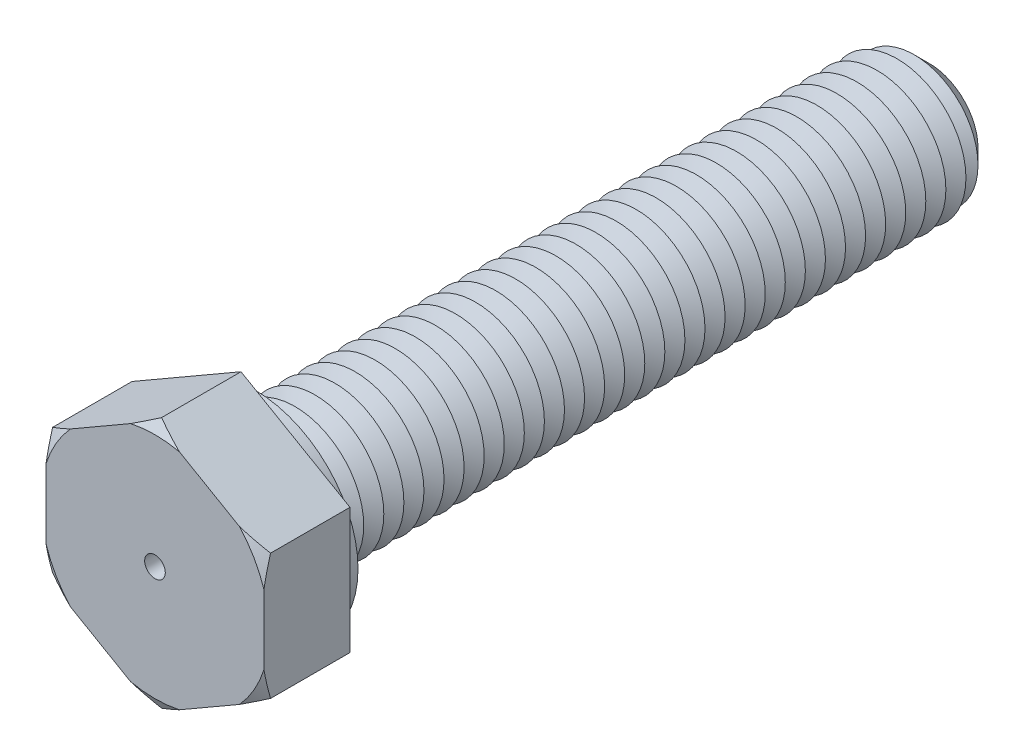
ISO-10303-21;
HEADER;
FILE_DESCRIPTION(('STEP AP214'),'2;1');
FILE_NAME('part.step','',(''),(''),'','','');
FILE_SCHEMA(('AUTOMOTIVE_DESIGN { 1 0 10303 214 1 1 1 1 }'));
ENDSEC;
DATA;
#1=APPLICATION_CONTEXT('core data for automotive mechanical design processes');
#2=APPLICATION_PROTOCOL_DEFINITION('international standard','automotive_design',2000,#1);
#3=PRODUCT_CONTEXT('',#1,'mechanical');
#4=PRODUCT('Part','Part','',(#3));
#5=PRODUCT_RELATED_PRODUCT_CATEGORY('part','',(#4));
#6=PRODUCT_DEFINITION_FORMATION('','',#4);
#7=PRODUCT_DEFINITION_CONTEXT('part definition',#1,'design');
#8=PRODUCT_DEFINITION('design','',#6,#7);
#9=PRODUCT_DEFINITION_SHAPE('','',#8);
#10=(LENGTH_UNIT() NAMED_UNIT(*) SI_UNIT(.MILLI.,.METRE.));
#11=(NAMED_UNIT(*) PLANE_ANGLE_UNIT() SI_UNIT($,.RADIAN.));
#12=(NAMED_UNIT(*) SI_UNIT($,.STERADIAN.) SOLID_ANGLE_UNIT());
#13=UNCERTAINTY_MEASURE_WITH_UNIT(LENGTH_MEASURE(1.E-05),#10,'distance_accuracy_value','');
#14=(GEOMETRIC_REPRESENTATION_CONTEXT(3) GLOBAL_UNCERTAINTY_ASSIGNED_CONTEXT((#13)) GLOBAL_UNIT_ASSIGNED_CONTEXT((#10,
#11,#12)) REPRESENTATION_CONTEXT('',''));
#15=CARTESIAN_POINT('',(0.,0.,0.));
#16=DIRECTION('',(0.,0.,1.));
#17=DIRECTION('',(1.,0.,0.));
#18=AXIS2_PLACEMENT_3D('',#15,#16,#17);
#19=CARTESIAN_POINT('',(9.5,5.48482755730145,7.5));
#20=DIRECTION('',(-0.5,-0.866025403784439,0.));
#21=DIRECTION('',(0.866025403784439,-0.5,0.));
#22=AXIS2_PLACEMENT_3D('',#19,#20,#21);
#23=PLANE('',#22);
#24=CARTESIAN_POINT('',(16.0911028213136,1.67945256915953,3.91531658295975));
#25=CARTESIAN_POINT('',(15.7926530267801,1.85176263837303,4.07633378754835));
#26=CARTESIAN_POINT('',(15.4934885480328,2.02448533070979,4.2356118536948));
#27=CARTESIAN_POINT('',(14.8934288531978,2.37092995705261,4.54987291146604));
#28=CARTESIAN_POINT('',(14.5925334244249,2.54465201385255,4.70485536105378));
#29=CARTESIAN_POINT('',(13.9878148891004,2.89378642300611,5.01015744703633));
#30=CARTESIAN_POINT('',(13.683985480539,3.06920241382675,5.16046049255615));
#31=CARTESIAN_POINT('',(13.0740489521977,3.42134943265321,5.45475890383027));
#32=CARTESIAN_POINT('',(12.7679419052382,3.5980804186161,5.59875447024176));
#33=CARTESIAN_POINT('',(12.1452865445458,3.95757065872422,5.88261207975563));
#34=CARTESIAN_POINT('',(11.8286703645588,4.14036909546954,6.02227655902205));
#35=CARTESIAN_POINT('',(11.1922429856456,4.50781061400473,6.29164435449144));
#36=CARTESIAN_POINT('',(10.8724316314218,4.69245378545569,6.42134718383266));
#37=CARTESIAN_POINT('',(10.2295404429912,5.06362718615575,6.66831982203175));
#38=CARTESIAN_POINT('',(9.90646410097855,5.25015539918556,6.78560163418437));
#39=CARTESIAN_POINT('',(9.25651830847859,5.62540177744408,7.00502233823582));
#40=CARTESIAN_POINT('',(8.92964935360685,5.81411965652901,7.10716318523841));
#41=CARTESIAN_POINT('',(8.14786487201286,6.26548313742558,7.32807954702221));
#42=CARTESIAN_POINT('',(7.69112739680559,6.52918064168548,7.43861218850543));
#43=CARTESIAN_POINT('',(7.00135730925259,6.92741958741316,7.57140056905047));
#44=CARTESIAN_POINT('',(6.77066782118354,7.06060822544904,7.61016053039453));
#45=CARTESIAN_POINT('',(6.30799755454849,7.32773102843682,7.67570810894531));
#46=CARTESIAN_POINT('',(6.07601678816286,7.46166518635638,7.70249583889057));
#47=CARTESIAN_POINT('',(5.6139056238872,7.72846519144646,7.74308971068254));
#48=CARTESIAN_POINT('',(5.38378495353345,7.8613254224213,7.75704275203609));
#49=CARTESIAN_POINT('',(4.92322735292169,8.12722847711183,7.77208284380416));
#50=CARTESIAN_POINT('',(4.69279042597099,8.26027129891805,7.7731700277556));
#51=CARTESIAN_POINT('',(4.23214422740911,8.52622550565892,7.76244373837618));
#52=CARTESIAN_POINT('',(4.00193495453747,8.65913689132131,7.75063033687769));
#53=CARTESIAN_POINT('',(3.54223236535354,8.92454630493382,7.71446028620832));
#54=CARTESIAN_POINT('',(3.31273916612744,9.0570442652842,7.69010168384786));
#55=CARTESIAN_POINT('',(2.77042202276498,9.37015121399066,7.61833387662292));
#56=CARTESIAN_POINT('',(2.45810922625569,9.55046509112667,7.56573497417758));
#57=CARTESIAN_POINT('',(1.83647686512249,9.9093647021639,7.44074774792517));
#58=CARTESIAN_POINT('',(1.52715774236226,10.087950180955,7.36835654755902));
#59=CARTESIAN_POINT('',(0.91154906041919,10.4433720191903,7.20651778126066));
#60=CARTESIAN_POINT('',(0.605263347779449,10.6202061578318,7.11705090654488));
#61=CARTESIAN_POINT('',(-0.00386858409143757,10.9718886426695,6.92387899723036));
#62=CARTESIAN_POINT('',(-0.306715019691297,11.1467371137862,6.82017486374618));
#63=CARTESIAN_POINT('',(-0.912759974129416,11.496637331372,6.59968787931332));
#64=CARTESIAN_POINT('',(-1.21591973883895,11.6716667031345,6.48276398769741));
#65=CARTESIAN_POINT('',(-1.81902771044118,12.0198712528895,6.2391105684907));
#66=CARTESIAN_POINT('',(-2.11897790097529,12.1930475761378,6.11238754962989));
#67=CARTESIAN_POINT('',(-2.71614501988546,12.5378221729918,5.85087494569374));
#68=CARTESIAN_POINT('',(-3.01336251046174,12.7094207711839,5.71608706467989));
#69=CARTESIAN_POINT('',(-3.60546807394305,13.0512730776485,5.4398567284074));
#70=CARTESIAN_POINT('',(-3.90035610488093,13.2215267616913,5.2984141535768));
#71=CARTESIAN_POINT('',(-4.39671248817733,13.5080982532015,5.0548695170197));
#72=CARTESIAN_POINT('',(-4.5987146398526,13.6247242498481,4.95421186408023));
#73=CARTESIAN_POINT('',(-5.00183994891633,13.8574687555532,4.75059724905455));
#74=CARTESIAN_POINT('',(-5.20296313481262,13.9735872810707,4.64764036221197));
#75=CARTESIAN_POINT('',(-5.60231741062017,14.2041545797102,4.44078592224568));
#76=CARTESIAN_POINT('',(-5.80055672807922,14.3186081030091,4.3369095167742));
#77=CARTESIAN_POINT('',(-6.19633679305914,14.5471118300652,4.12738601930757));
#78=CARTESIAN_POINT('',(-6.39387752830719,14.6611620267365,4.02173889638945));
#79=CARTESIAN_POINT('',(-6.59110282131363,14.7750301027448,3.91531658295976));
#80=B_SPLINE_CURVE_WITH_KNOTS('',3,(#24,#25,#26,#27,#28,#29,#30,#31,#32,#33,#34,#35,#36,#37,#38,
#39,#40,#41,#42,#43,#44,#45,#46,#47,#48,#49,#50,#51,#52,#53,#54,#55,#56,#57,#58,#59,#60,#61,#62,
#63,#64,#65,#66,#67,#68,#69,#70,#71,#72,#73,#74,#75,#76,#77,#78,#79),.UNSPECIFIED.,.F.,.F.,(4,2,
2,2,2,2,2,2,2,2,2,2,2,2,2,2,2,2,2,2,2,2,2,2,2,2,2,4),(0.,1.14115474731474,2.28245284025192,
3.42741980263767,4.57235031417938,5.74632926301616,6.92036555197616,8.09325673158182,
9.26599632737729,10.8807998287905,11.6881240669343,12.4954407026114,13.2933978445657,
14.0913467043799,14.8892911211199,15.6873598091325,16.7800286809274,17.8728564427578,
18.9669273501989,20.0609290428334,21.1679585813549,22.2742590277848,23.3803265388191,
24.486413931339,25.2485345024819,26.0106301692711,26.7647435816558,27.5188701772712),.UNSPECIFIED.);
#81=CARTESIAN_POINT('',(9.5,5.48482755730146,6.92264973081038));
#82=VERTEX_POINT('',#81);
#83=CARTESIAN_POINT('',(7.36878164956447,6.71528704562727,7.5));
#84=VERTEX_POINT('',#83);
#85=EDGE_CURVE('E131',#82,#84,#80,.T.);
#86=ORIENTED_EDGE('',*,*,#85,.F.);
#87=DIRECTION('',(0.,0.,-1.));
#88=VECTOR('',#87,1.);
#89=CARTESIAN_POINT('',(9.5,5.48482755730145,7.5));
#90=LINE('',#89,#88);
#91=CARTESIAN_POINT('',(9.5,5.48482755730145,0.));
#92=VERTEX_POINT('',#91);
#93=EDGE_CURVE('E143',#82,#92,#90,.T.);
#94=ORIENTED_EDGE('',*,*,#93,.T.);
#95=DIRECTION('',(-0.866025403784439,0.5,0.));
#96=VECTOR('',#95,1.);
#97=CARTESIAN_POINT('',(9.5,5.48482755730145,0.));
#98=LINE('',#97,#96);
#99=CARTESIAN_POINT('',(0.,10.9696551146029,0.));
#100=VERTEX_POINT('',#99);
#101=EDGE_CURVE('E464',#92,#100,#98,.T.);
#102=ORIENTED_EDGE('',*,*,#101,.T.);
#103=DIRECTION('',(0.,0.,-1.));
#104=VECTOR('',#103,1.);
#105=CARTESIAN_POINT('',(0.,10.9696551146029,7.5));
#106=LINE('',#105,#104);
#107=CARTESIAN_POINT('',(0.,10.9696551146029,6.92264973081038));
#108=VERTEX_POINT('',#107);
#109=EDGE_CURVE('E177',#108,#100,#106,.T.);
#110=ORIENTED_EDGE('',*,*,#109,.F.);
#111=CARTESIAN_POINT('',(2.13121835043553,9.73919562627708,7.5));
#112=VERTEX_POINT('',#111);
#113=EDGE_CURVE('E150',#112,#108,#80,.T.);
#114=ORIENTED_EDGE('',*,*,#113,.F.);
#115=DIRECTION('',(-0.866025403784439,0.5,0.));
#116=VECTOR('',#115,1.);
#117=CARTESIAN_POINT('',(9.5,5.48482755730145,7.5));
#118=LINE('',#117,#116);
#119=EDGE_CURVE('E147',#84,#112,#118,.T.);
#120=ORIENTED_EDGE('',*,*,#119,.F.);
#121=EDGE_LOOP('',(#86,#94,#102,#110,#114,#120));
#122=FACE_BOUND('',#121,.T.);
#123=ADVANCED_FACE('F38',(#122),#23,.F.);
#124=CARTESIAN_POINT('',(0.,10.9696551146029,7.5));
#125=DIRECTION('',(0.5,-0.866025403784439,0.));
#126=DIRECTION('',(0.866025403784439,0.5,0.));
#127=AXIS2_PLACEMENT_3D('',#124,#125,#126);
#128=PLANE('',#127);
#129=CARTESIAN_POINT('',(6.59110282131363,14.7750301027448,3.91531658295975));
#130=CARTESIAN_POINT('',(6.29265302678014,14.6027200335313,4.07633378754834));
#131=CARTESIAN_POINT('',(5.99348854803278,14.4299973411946,4.2356118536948));
#132=CARTESIAN_POINT('',(5.3934288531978,14.0835527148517,4.54987291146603));
#133=CARTESIAN_POINT('',(5.09253342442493,13.9098306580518,4.70485536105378));
#134=CARTESIAN_POINT('',(4.48781488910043,13.5606962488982,5.01015744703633));
#135=CARTESIAN_POINT('',(4.18398548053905,13.3852802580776,5.16046049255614));
#136=CARTESIAN_POINT('',(3.57404895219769,13.0331332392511,5.45475890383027));
#137=CARTESIAN_POINT('',(3.26794190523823,12.8564022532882,5.59875447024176));
#138=CARTESIAN_POINT('',(2.64528654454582,12.4969120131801,5.88261207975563));
#139=CARTESIAN_POINT('',(2.32867036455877,12.3141135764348,6.02227655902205));
#140=CARTESIAN_POINT('',(1.69224298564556,11.9466720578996,6.29164435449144));
#141=CARTESIAN_POINT('',(1.37243163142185,11.7620288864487,6.42134718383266));
#142=CARTESIAN_POINT('',(0.729540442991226,11.3908554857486,6.66831982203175));
#143=CARTESIAN_POINT('',(0.406464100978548,11.2043272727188,6.78560163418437));
#144=CARTESIAN_POINT('',(-0.243481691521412,10.8290808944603,7.00502233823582));
#145=CARTESIAN_POINT('',(-0.570350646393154,10.6403630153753,7.10716318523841));
#146=CARTESIAN_POINT('',(-1.35213512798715,10.1889995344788,7.32807954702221));
#147=CARTESIAN_POINT('',(-1.80887260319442,9.92530203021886,7.43861218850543));
#148=CARTESIAN_POINT('',(-2.49864269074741,9.52706308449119,7.57140056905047));
#149=CARTESIAN_POINT('',(-2.72933217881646,9.3938744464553,7.61016053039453));
#150=CARTESIAN_POINT('',(-3.19200244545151,9.12675164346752,7.67570810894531));
#151=CARTESIAN_POINT('',(-3.42398321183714,8.99281748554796,7.70249583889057));
#152=CARTESIAN_POINT('',(-3.8860943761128,8.72601748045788,7.74308971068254));
#153=CARTESIAN_POINT('',(-4.11621504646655,8.59315724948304,7.75704275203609));
#154=CARTESIAN_POINT('',(-4.57677264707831,8.32725419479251,7.77208284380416));
#155=CARTESIAN_POINT('',(-4.80720957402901,8.1942113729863,7.7731700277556));
#156=CARTESIAN_POINT('',(-5.26785577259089,7.92825716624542,7.76244373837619));
#157=CARTESIAN_POINT('',(-5.49806504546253,7.79534578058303,7.7506303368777));
#158=CARTESIAN_POINT('',(-5.95776763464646,7.52993636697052,7.71446028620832));
#159=CARTESIAN_POINT('',(-6.18726083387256,7.39743840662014,7.69010168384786));
#160=CARTESIAN_POINT('',(-6.72957797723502,7.08433145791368,7.61833387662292));
#161=CARTESIAN_POINT('',(-7.04189077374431,6.90401758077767,7.56573497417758));
#162=CARTESIAN_POINT('',(-7.66352313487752,6.54511796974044,7.44074774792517));
#163=CARTESIAN_POINT('',(-7.97284225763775,6.36653249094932,7.36835654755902));
#164=CARTESIAN_POINT('',(-8.58845093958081,6.01111065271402,7.20651778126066));
#165=CARTESIAN_POINT('',(-8.89473665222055,5.83427651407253,7.11705090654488));
#166=CARTESIAN_POINT('',(-9.50386858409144,5.48259402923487,6.92387899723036));
#167=CARTESIAN_POINT('',(-9.8067150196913,5.30774555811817,6.82017486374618));
#168=CARTESIAN_POINT('',(-10.4127599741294,4.95784534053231,6.59968787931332));
#169=CARTESIAN_POINT('',(-10.715919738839,4.7828159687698,6.48276398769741));
#170=CARTESIAN_POINT('',(-11.3190277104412,4.43461141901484,6.2391105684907));
#171=CARTESIAN_POINT('',(-11.6189779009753,4.2614350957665,6.11238754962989));
#172=CARTESIAN_POINT('',(-12.2161450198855,3.91666049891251,5.85087494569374));
#173=CARTESIAN_POINT('',(-12.5133625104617,3.74506190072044,5.71608706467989));
#174=CARTESIAN_POINT('',(-13.1054680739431,3.40320959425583,5.43985672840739));
#175=CARTESIAN_POINT('',(-13.4003561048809,3.23295591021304,5.2984141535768));
#176=CARTESIAN_POINT('',(-13.8967124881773,2.94638441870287,5.0548695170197));
#177=CARTESIAN_POINT('',(-14.0987146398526,2.82975842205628,4.95421186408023));
#178=CARTESIAN_POINT('',(-14.5018399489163,2.59701391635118,4.75059724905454));
#179=CARTESIAN_POINT('',(-14.7029631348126,2.48089539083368,4.64764036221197));
#180=CARTESIAN_POINT('',(-15.1023174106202,2.25032809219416,4.44078592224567));
#181=CARTESIAN_POINT('',(-15.3005567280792,2.13587456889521,4.3369095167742));
#182=CARTESIAN_POINT('',(-15.6963367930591,1.90737084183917,4.12738601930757));
#183=CARTESIAN_POINT('',(-15.8938775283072,1.79332064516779,4.02173889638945));
#184=CARTESIAN_POINT('',(-16.0911028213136,1.67945256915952,3.91531658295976));
#185=B_SPLINE_CURVE_WITH_KNOTS('',3,(#129,#130,#131,#132,#133,#134,#135,#136,#137,#138,#139,
#140,#141,#142,#143,#144,#145,#146,#147,#148,#149,#150,#151,#152,#153,#154,#155,#156,#157,#158,
#159,#160,#161,#162,#163,#164,#165,#166,#167,#168,#169,#170,#171,#172,#173,#174,#175,#176,#177,
#178,#179,#180,#181,#182,#183,#184),.UNSPECIFIED.,.F.,.F.,(4,2,2,2,2,2,2,2,2,2,2,2,2,2,2,2,2,2,
2,2,2,2,2,2,2,2,2,4),(0.,1.14115474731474,2.28245284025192,3.42741980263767,4.57235031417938,
5.74632926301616,6.92036555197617,8.09325673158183,9.2659963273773,10.8807998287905,
11.6881240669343,12.4954407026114,13.2933978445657,14.0913467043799,14.8892911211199,
15.6873598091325,16.7800286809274,17.8728564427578,18.9669273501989,20.0609290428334,
21.1679585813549,22.2742590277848,23.3803265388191,24.486413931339,25.2485345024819,
26.0106301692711,26.7647435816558,27.5188701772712),.UNSPECIFIED.);
#186=CARTESIAN_POINT('',(-2.13121835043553,9.73919562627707,7.5));
#187=VERTEX_POINT('',#186);
#188=EDGE_CURVE('E604',#108,#187,#185,.T.);
#189=ORIENTED_EDGE('',*,*,#188,.F.);
#190=ORIENTED_EDGE('',*,*,#109,.T.);
#191=DIRECTION('',(-0.866025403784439,-0.5,0.));
#192=VECTOR('',#191,1.);
#193=CARTESIAN_POINT('',(0.,10.9696551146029,0.));
#194=LINE('',#193,#192);
#195=CARTESIAN_POINT('',(-9.5,5.48482755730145,0.));
#196=VERTEX_POINT('',#195);
#197=EDGE_CURVE('E484',#100,#196,#194,.T.);
#198=ORIENTED_EDGE('',*,*,#197,.T.);
#199=DIRECTION('',(0.,0.,-1.));
#200=VECTOR('',#199,1.);
#201=CARTESIAN_POINT('',(-9.5,5.48482755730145,7.5));
#202=LINE('',#201,#200);
#203=CARTESIAN_POINT('',(-9.5,5.48482755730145,6.92264973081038));
#204=VERTEX_POINT('',#203);
#205=EDGE_CURVE('E174',#204,#196,#202,.T.);
#206=ORIENTED_EDGE('',*,*,#205,.F.);
#207=CARTESIAN_POINT('',(-7.36878164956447,6.71528704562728,7.5));
#208=VERTEX_POINT('',#207);
#209=EDGE_CURVE('E536',#208,#204,#185,.T.);
#210=ORIENTED_EDGE('',*,*,#209,.F.);
#211=DIRECTION('',(-0.866025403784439,-0.5,0.));
#212=VECTOR('',#211,1.);
#213=CARTESIAN_POINT('',(0.,10.9696551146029,7.5));
#214=LINE('',#213,#212);
#215=EDGE_CURVE('E467',#187,#208,#214,.T.);
#216=ORIENTED_EDGE('',*,*,#215,.F.);
#217=EDGE_LOOP('',(#189,#190,#198,#206,#210,#216));
#218=FACE_BOUND('',#217,.T.);
#219=ADVANCED_FACE('F593',(#218),#128,.F.);
#220=CARTESIAN_POINT('',(-9.5,5.48482755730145,7.5));
#221=DIRECTION('',(1.,0.,0.));
#222=DIRECTION('',(0.,0.,-1.));
#223=AXIS2_PLACEMENT_3D('',#220,#221,#222);
#224=PLANE('',#223);
#225=CARTESIAN_POINT('',(-9.5,12.0759303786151,4.38509256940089));
#226=CARTESIAN_POINT('',(-9.5,11.7327439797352,4.54077735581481));
#227=CARTESIAN_POINT('',(-9.5,11.388618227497,4.69443095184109));
#228=CARTESIAN_POINT('',(-9.5,10.698085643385,4.99669009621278));
#229=CARTESIAN_POINT('',(-9.5,10.3516784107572,5.14529472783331));
#230=CARTESIAN_POINT('',(-9.5,9.65484997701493,5.43702212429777));
#231=CARTESIAN_POINT('',(-9.5,9.30441804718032,5.58011936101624));
#232=CARTESIAN_POINT('',(-9.5,8.60059023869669,5.85880989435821));
#233=CARTESIAN_POINT('',(-9.5,8.24719449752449,5.9944035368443));
#234=CARTESIAN_POINT('',(-9.5,7.53860340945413,6.25582574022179));
#235=CARTESIAN_POINT('',(-9.5,7.18342337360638,6.38169559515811));
#236=CARTESIAN_POINT('',(-9.5,6.46926569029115,6.62229858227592));
#237=CARTESIAN_POINT('',(-9.5,6.11028785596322,6.73703116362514));
#238=CARTESIAN_POINT('',(-9.5,5.38872372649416,6.95272419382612));
#239=CARTESIAN_POINT('',(-9.5,5.02614305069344,7.05370330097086));
#240=CARTESIAN_POINT('',(-9.5,4.29675196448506,7.23920160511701));
#241=CARTESIAN_POINT('',(-9.5,3.92994173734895,7.32372151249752));
#242=CARTESIAN_POINT('',(-9.5,3.29665308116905,7.45205940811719));
#243=CARTESIAN_POINT('',(-9.5,3.03113701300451,7.50062833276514));
#244=CARTESIAN_POINT('',(-9.5,2.49832809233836,7.5865841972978));
#245=CARTESIAN_POINT('',(-9.5,2.23103554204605,7.62397299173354));
#246=CARTESIAN_POINT('',(-9.5,1.69506861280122,7.68659004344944));
#247=CARTESIAN_POINT('',(-9.5,1.42639449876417,7.71182055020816));
#248=CARTESIAN_POINT('',(-9.5,0.888138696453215,7.74939803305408));
#249=CARTESIAN_POINT('',(-9.5,0.618557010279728,7.76174503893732));
#250=CARTESIAN_POINT('',(-9.5,0.0792458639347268,7.77317034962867));
#251=CARTESIAN_POINT('',(-9.5,-0.190483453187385,7.77225534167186));
#252=CARTESIAN_POINT('',(-9.5,-0.729567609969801,7.75720205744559));
#253=CARTESIAN_POINT('',(-9.5,-0.998922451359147,7.74306384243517));
#254=CARTESIAN_POINT('',(-9.5,-1.53667618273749,7.70199575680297));
#255=CARTESIAN_POINT('',(-9.5,-1.80507496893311,7.67506453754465));
#256=CARTESIAN_POINT('',(-9.5,-2.34038611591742,7.60918517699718));
#257=CARTESIAN_POINT('',(-9.5,-2.60729841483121,7.57023653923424));
#258=CARTESIAN_POINT('',(-9.5,-3.27166409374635,7.45918941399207));
#259=CARTESIAN_POINT('',(-9.5,-3.66797754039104,7.38023980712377));
#260=CARTESIAN_POINT('',(-9.5,-4.45585575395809,7.20141943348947));
#261=CARTESIAN_POINT('',(-9.5,-4.84741945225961,7.10154404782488));
#262=CARTESIAN_POINT('',(-9.5,-5.62657130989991,6.88438943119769));
#263=CARTESIAN_POINT('',(-9.5,-6.01414884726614,6.76707245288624));
#264=CARTESIAN_POINT('',(-9.5,-6.78474185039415,6.51851091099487));
#265=CARTESIAN_POINT('',(-9.5,-7.16775763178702,6.38726731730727));
#266=CARTESIAN_POINT('',(-9.5,-7.93407213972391,6.11202298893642));
#267=CARTESIAN_POINT('',(-9.5,-8.31732458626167,5.96789419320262));
#268=CARTESIAN_POINT('',(-9.5,-9.08024927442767,5.67043108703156));
#269=CARTESIAN_POINT('',(-9.5,-9.4599212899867,5.51709619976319));
#270=CARTESIAN_POINT('',(-9.5,-10.2138362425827,5.20397874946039));
#271=CARTESIAN_POINT('',(-9.5,-10.5880982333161,5.04424191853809));
#272=CARTESIAN_POINT('',(-9.5,-11.1474871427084,4.80018423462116));
#273=CARTESIAN_POINT('',(-9.5,-11.3335947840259,4.7180993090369));
#274=CARTESIAN_POINT('',(-9.5,-11.7052038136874,4.55257683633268));
#275=CARTESIAN_POINT('',(-9.5,-11.8907052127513,4.46913931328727));
#276=CARTESIAN_POINT('',(-9.5,-12.0759303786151,4.38509256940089));
#277=B_SPLINE_CURVE_WITH_KNOTS('',3,(#225,#226,#227,#228,#229,#230,#231,#232,#233,#234,#235,
#236,#237,#238,#239,#240,#241,#242,#243,#244,#245,#246,#247,#248,#249,#250,#251,#252,#253,#254,
#255,#256,#257,#258,#259,#260,#261,#262,#263,#264,#265,#266,#267,#268,#269,#270,#271,#272,#273,
#274,#275,#276),.UNSPECIFIED.,.F.,.F.,(4,2,2,2,2,2,2,2,2,2,2,2,2,2,2,2,2,2,2,2,2,2,2,2,2,4),(0.,
1.13056270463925,2.26132959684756,3.39682602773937,4.53227007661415,5.66259174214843,
6.79296928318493,7.92179771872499,9.05057742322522,9.86013572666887,10.6695596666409,
11.4788337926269,12.288106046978,13.0969702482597,13.9058307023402,14.7147764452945,
15.5237556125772,16.7353316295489,17.9471753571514,19.1616810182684,20.3761021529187,
21.6043286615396,22.8326322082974,24.0533405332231,24.6635541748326,25.273756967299),.UNSPECIFIED.);
#278=CARTESIAN_POINT('',(-9.5,3.02390858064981,7.5));
#279=VERTEX_POINT('',#278);
#280=EDGE_CURVE('E526',#204,#279,#277,.T.);
#281=ORIENTED_EDGE('',*,*,#280,.F.);
#282=ORIENTED_EDGE('',*,*,#205,.T.);
#283=DIRECTION('',(0.,-1.,0.));
#284=VECTOR('',#283,1.);
#285=CARTESIAN_POINT('',(-9.5,5.48482755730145,0.));
#286=LINE('',#285,#284);
#287=CARTESIAN_POINT('',(-9.5,-5.48482755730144,0.));
#288=VERTEX_POINT('',#287);
#289=EDGE_CURVE('E488',#196,#288,#286,.T.);
#290=ORIENTED_EDGE('',*,*,#289,.T.);
#291=DIRECTION('',(0.,0.,-1.));
#292=VECTOR('',#291,1.);
#293=CARTESIAN_POINT('',(-9.5,-5.48482755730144,7.5));
#294=LINE('',#293,#292);
#295=CARTESIAN_POINT('',(-9.50000000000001,-5.48482755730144,6.92264973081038));
#296=VERTEX_POINT('',#295);
#297=EDGE_CURVE('E171',#296,#288,#294,.T.);
#298=ORIENTED_EDGE('',*,*,#297,.F.);
#299=CARTESIAN_POINT('',(-9.50000000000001,-3.02390858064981,7.5));
#300=VERTEX_POINT('',#299);
#301=EDGE_CURVE('E529',#300,#296,#277,.T.);
#302=ORIENTED_EDGE('',*,*,#301,.F.);
#303=DIRECTION('',(0.,-1.,0.));
#304=VECTOR('',#303,1.);
#305=CARTESIAN_POINT('',(-9.5,5.48482755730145,7.5));
#306=LINE('',#305,#304);
#307=EDGE_CURVE('E471',#279,#300,#306,.T.);
#308=ORIENTED_EDGE('',*,*,#307,.F.);
#309=EDGE_LOOP('',(#281,#282,#290,#298,#302,#308));
#310=FACE_BOUND('',#309,.T.);
#311=ADVANCED_FACE('F525',(#310),#224,.F.);
#312=CARTESIAN_POINT('',(-9.5,-5.48482755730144,7.5));
#313=DIRECTION('',(0.5,0.866025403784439,0.));
#314=DIRECTION('',(-0.866025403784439,0.5,0.));
#315=AXIS2_PLACEMENT_3D('',#312,#313,#314);
#316=PLANE('',#315);
#317=CARTESIAN_POINT('',(-16.0911028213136,-1.67945256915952,3.91531658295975));
#318=CARTESIAN_POINT('',(-15.7926530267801,-1.85176263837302,4.07633378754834));
#319=CARTESIAN_POINT('',(-15.4934885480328,-2.02448533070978,4.2356118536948));
#320=CARTESIAN_POINT('',(-14.8934288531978,-2.3709299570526,4.54987291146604));
#321=CARTESIAN_POINT('',(-14.5925334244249,-2.54465201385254,4.70485536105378));
#322=CARTESIAN_POINT('',(-13.9878148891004,-2.8937864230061,5.01015744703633));
#323=CARTESIAN_POINT('',(-13.6839854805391,-3.06920241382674,5.16046049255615));
#324=CARTESIAN_POINT('',(-13.0740489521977,-3.4213494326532,5.45475890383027));
#325=CARTESIAN_POINT('',(-12.7679419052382,-3.59808041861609,5.59875447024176));
#326=CARTESIAN_POINT('',(-12.1452865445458,-3.95757065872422,5.88261207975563));
#327=CARTESIAN_POINT('',(-11.8286703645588,-4.14036909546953,6.02227655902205));
#328=CARTESIAN_POINT('',(-11.1922429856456,-4.50781061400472,6.29164435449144));
#329=CARTESIAN_POINT('',(-10.8724316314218,-4.69245378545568,6.42134718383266));
#330=CARTESIAN_POINT('',(-10.2295404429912,-5.06362718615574,6.66831982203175));
#331=CARTESIAN_POINT('',(-9.90646410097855,-5.25015539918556,6.78560163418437));
#332=CARTESIAN_POINT('',(-9.25651830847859,-5.62540177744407,7.00502233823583));
#333=CARTESIAN_POINT('',(-8.92964935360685,-5.81411965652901,7.10716318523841));
#334=CARTESIAN_POINT('',(-8.14786487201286,-6.26548313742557,7.32807954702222));
#335=CARTESIAN_POINT('',(-7.69112739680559,-6.52918064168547,7.43861218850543));
#336=CARTESIAN_POINT('',(-7.0013573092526,-6.92741958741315,7.57140056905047));
#337=CARTESIAN_POINT('',(-6.77066782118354,-7.06060822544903,7.61016053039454));
#338=CARTESIAN_POINT('',(-6.3079975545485,-7.32773102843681,7.67570810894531));
#339=CARTESIAN_POINT('',(-6.07601678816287,-7.46166518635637,7.70249583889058));
#340=CARTESIAN_POINT('',(-5.61390562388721,-7.72846519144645,7.74308971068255));
#341=CARTESIAN_POINT('',(-5.38378495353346,-7.86132542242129,7.75704275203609));
#342=CARTESIAN_POINT('',(-4.9232273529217,-8.12722847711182,7.77208284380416));
#343=CARTESIAN_POINT('',(-4.69279042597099,-8.26027129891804,7.7731700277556));
#344=CARTESIAN_POINT('',(-4.23214422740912,-8.52622550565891,7.76244373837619));
#345=CARTESIAN_POINT('',(-4.00193495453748,-8.6591368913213,7.7506303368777));
#346=CARTESIAN_POINT('',(-3.54223236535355,-8.92454630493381,7.71446028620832));
#347=CARTESIAN_POINT('',(-3.31273916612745,-9.05704426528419,7.69010168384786));
#348=CARTESIAN_POINT('',(-2.77042202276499,-9.37015121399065,7.61833387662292));
#349=CARTESIAN_POINT('',(-2.4581092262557,-9.55046509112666,7.56573497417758));
#350=CARTESIAN_POINT('',(-1.8364768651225,-9.90936470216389,7.44074774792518));
#351=CARTESIAN_POINT('',(-1.52715774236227,-10.087950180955,7.36835654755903));
#352=CARTESIAN_POINT('',(-0.911549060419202,-10.4433720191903,7.20651778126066));
#353=CARTESIAN_POINT('',(-0.605263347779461,-10.6202061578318,7.11705090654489));
#354=CARTESIAN_POINT('',(0.00386858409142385,-10.9718886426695,6.92387899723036));
#355=CARTESIAN_POINT('',(0.306715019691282,-11.1467371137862,6.82017486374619));
#356=CARTESIAN_POINT('',(0.912759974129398,-11.496637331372,6.59968787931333));
#357=CARTESIAN_POINT('',(1.21591973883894,-11.6716667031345,6.48276398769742));
#358=CARTESIAN_POINT('',(1.81902771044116,-12.0198712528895,6.23911056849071));
#359=CARTESIAN_POINT('',(2.11897790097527,-12.1930475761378,6.1123875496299));
#360=CARTESIAN_POINT('',(2.71614501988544,-12.5378221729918,5.85087494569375));
#361=CARTESIAN_POINT('',(3.01336251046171,-12.7094207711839,5.7160870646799));
#362=CARTESIAN_POINT('',(3.60546807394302,-13.0512730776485,5.43985672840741));
#363=CARTESIAN_POINT('',(3.90035610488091,-13.2215267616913,5.29841415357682));
#364=CARTESIAN_POINT('',(4.39671248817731,-13.5080982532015,5.05486951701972));
#365=CARTESIAN_POINT('',(4.59871463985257,-13.624724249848,4.95421186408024));
#366=CARTESIAN_POINT('',(5.00183994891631,-13.8574687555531,4.75059724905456));
#367=CARTESIAN_POINT('',(5.20296313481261,-13.9735872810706,4.64764036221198));
#368=CARTESIAN_POINT('',(5.60231741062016,-14.2041545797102,4.44078592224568));
#369=CARTESIAN_POINT('',(5.80055672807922,-14.3186081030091,4.33690951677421));
#370=CARTESIAN_POINT('',(6.19633679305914,-14.5471118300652,4.12738601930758));
#371=CARTESIAN_POINT('',(6.39387752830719,-14.6611620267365,4.02173889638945));
#372=CARTESIAN_POINT('',(6.59110282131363,-14.7750301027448,3.91531658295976));
#373=B_SPLINE_CURVE_WITH_KNOTS('',3,(#317,#318,#319,#320,#321,#322,#323,#324,#325,#326,#327,
#328,#329,#330,#331,#332,#333,#334,#335,#336,#337,#338,#339,#340,#341,#342,#343,#344,#345,#346,
#347,#348,#349,#350,#351,#352,#353,#354,#355,#356,#357,#358,#359,#360,#361,#362,#363,#364,#365,
#366,#367,#368,#369,#370,#371,#372),.UNSPECIFIED.,.F.,.F.,(4,2,2,2,2,2,2,2,2,2,2,2,2,2,2,2,2,2,
2,2,2,2,2,2,2,2,2,4),(0.,1.14115474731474,2.28245284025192,3.42741980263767,4.57235031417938,
5.74632926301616,6.92036555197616,8.09325673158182,9.26599632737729,10.8807998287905,
11.6881240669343,12.4954407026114,13.2933978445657,14.0913467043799,14.8892911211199,
15.6873598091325,16.7800286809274,17.8728564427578,18.9669273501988,20.0609290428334,
21.1679585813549,22.2742590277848,23.3803265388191,24.4864139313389,25.2485345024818,
26.010630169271,26.7647435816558,27.5188701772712),.UNSPECIFIED.);
#374=CARTESIAN_POINT('',(-7.36878164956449,-6.71528704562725,7.5));
#375=VERTEX_POINT('',#374);
#376=EDGE_CURVE('E533',#296,#375,#373,.T.);
#377=ORIENTED_EDGE('',*,*,#376,.F.);
#378=ORIENTED_EDGE('',*,*,#297,.T.);
#379=DIRECTION('',(0.866025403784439,-0.5,0.));
#380=VECTOR('',#379,1.);
#381=CARTESIAN_POINT('',(-9.5,-5.48482755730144,0.));
#382=LINE('',#381,#380);
#383=CARTESIAN_POINT('',(0.,-10.9696551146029,0.));
#384=VERTEX_POINT('',#383);
#385=EDGE_CURVE('E492',#288,#384,#382,.T.);
#386=ORIENTED_EDGE('',*,*,#385,.T.);
#387=DIRECTION('',(0.,0.,-1.));
#388=VECTOR('',#387,1.);
#389=CARTESIAN_POINT('',(0.,-10.9696551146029,7.5));
#390=LINE('',#389,#388);
#391=CARTESIAN_POINT('',(0.,-10.9696551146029,6.92264973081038));
#392=VERTEX_POINT('',#391);
#393=EDGE_CURVE('E162',#392,#384,#390,.T.);
#394=ORIENTED_EDGE('',*,*,#393,.F.);
#395=CARTESIAN_POINT('',(-2.13121835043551,-9.73919562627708,7.5));
#396=VERTEX_POINT('',#395);
#397=EDGE_CURVE('E506',#396,#392,#373,.T.);
#398=ORIENTED_EDGE('',*,*,#397,.F.);
#399=DIRECTION('',(0.866025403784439,-0.5,0.));
#400=VECTOR('',#399,1.);
#401=CARTESIAN_POINT('',(-9.5,-5.48482755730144,7.5));
#402=LINE('',#401,#400);
#403=EDGE_CURVE('E475',#375,#396,#402,.T.);
#404=ORIENTED_EDGE('',*,*,#403,.F.);
#405=EDGE_LOOP('',(#377,#378,#386,#394,#398,#404));
#406=FACE_BOUND('',#405,.T.);
#407=ADVANCED_FACE('F584',(#406),#316,.F.);
#408=CARTESIAN_POINT('',(0.,-10.9696551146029,7.5));
#409=DIRECTION('',(-0.5,0.866025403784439,0.));
#410=DIRECTION('',(-0.866025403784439,-0.5,0.));
#411=AXIS2_PLACEMENT_3D('',#408,#409,#410);
#412=PLANE('',#411);
#413=CARTESIAN_POINT('',(-6.59110282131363,-14.7750301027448,3.91531658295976));
#414=CARTESIAN_POINT('',(-6.29265302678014,-14.6027200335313,4.07633378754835));
#415=CARTESIAN_POINT('',(-5.99348854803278,-14.4299973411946,4.2356118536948));
#416=CARTESIAN_POINT('',(-5.3934288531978,-14.0835527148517,4.54987291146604));
#417=CARTESIAN_POINT('',(-5.09253342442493,-13.9098306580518,4.70485536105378));
#418=CARTESIAN_POINT('',(-4.48781488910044,-13.5606962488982,5.01015744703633));
#419=CARTESIAN_POINT('',(-4.18398548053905,-13.3852802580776,5.16046049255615));
#420=CARTESIAN_POINT('',(-3.5740489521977,-13.0331332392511,5.45475890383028));
#421=CARTESIAN_POINT('',(-3.26794190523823,-12.8564022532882,5.59875447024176));
#422=CARTESIAN_POINT('',(-2.64528654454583,-12.4969120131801,5.88261207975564));
#423=CARTESIAN_POINT('',(-2.32867036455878,-12.3141135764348,6.02227655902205));
#424=CARTESIAN_POINT('',(-1.69224298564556,-11.9466720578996,6.29164435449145));
#425=CARTESIAN_POINT('',(-1.37243163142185,-11.7620288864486,6.42134718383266));
#426=CARTESIAN_POINT('',(-0.729540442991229,-11.3908554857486,6.66831982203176));
#427=CARTESIAN_POINT('',(-0.40646410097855,-11.2043272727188,6.78560163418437));
#428=CARTESIAN_POINT('',(0.243481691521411,-10.8290808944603,7.00502233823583));
#429=CARTESIAN_POINT('',(0.570350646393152,-10.6403630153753,7.10716318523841));
#430=CARTESIAN_POINT('',(1.35213512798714,-10.1889995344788,7.32807954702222));
#431=CARTESIAN_POINT('',(1.80887260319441,-9.92530203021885,7.43861218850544));
#432=CARTESIAN_POINT('',(2.49864269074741,-9.52706308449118,7.57140056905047));
#433=CARTESIAN_POINT('',(2.72933217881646,-9.3938744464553,7.61016053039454));
#434=CARTESIAN_POINT('',(3.19200244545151,-9.12675164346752,7.67570810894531));
#435=CARTESIAN_POINT('',(3.42398321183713,-8.99281748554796,7.70249583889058));
#436=CARTESIAN_POINT('',(3.8860943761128,-8.72601748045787,7.74308971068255));
#437=CARTESIAN_POINT('',(4.11621504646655,-8.59315724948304,7.75704275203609));
#438=CARTESIAN_POINT('',(4.57677264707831,-8.32725419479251,7.77208284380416));
#439=CARTESIAN_POINT('',(4.80720957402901,-8.19421137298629,7.7731700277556));
#440=CARTESIAN_POINT('',(5.26785577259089,-7.92825716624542,7.76244373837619));
#441=CARTESIAN_POINT('',(5.49806504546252,-7.79534578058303,7.7506303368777));
#442=CARTESIAN_POINT('',(5.95776763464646,-7.52993636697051,7.71446028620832));
#443=CARTESIAN_POINT('',(6.18726083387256,-7.39743840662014,7.69010168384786));
#444=CARTESIAN_POINT('',(6.72957797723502,-7.08433145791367,7.61833387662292));
#445=CARTESIAN_POINT('',(7.04189077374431,-6.90401758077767,7.56573497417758));
#446=CARTESIAN_POINT('',(7.66352313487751,-6.54511796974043,7.44074774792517));
#447=CARTESIAN_POINT('',(7.97284225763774,-6.36653249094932,7.36835654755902));
#448=CARTESIAN_POINT('',(8.58845093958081,-6.01111065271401,7.20651778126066));
#449=CARTESIAN_POINT('',(8.89473665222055,-5.83427651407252,7.11705090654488));
#450=CARTESIAN_POINT('',(9.50386858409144,-5.48259402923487,6.92387899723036));
#451=CARTESIAN_POINT('',(9.8067150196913,-5.30774555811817,6.82017486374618));
#452=CARTESIAN_POINT('',(10.4127599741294,-4.95784534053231,6.59968787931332));
#453=CARTESIAN_POINT('',(10.715919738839,-4.7828159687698,6.48276398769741));
#454=CARTESIAN_POINT('',(11.3190277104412,-4.43461141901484,6.2391105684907));
#455=CARTESIAN_POINT('',(11.6189779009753,-4.2614350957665,6.11238754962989));
#456=CARTESIAN_POINT('',(12.2161450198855,-3.91666049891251,5.85087494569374));
#457=CARTESIAN_POINT('',(12.5133625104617,-3.74506190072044,5.71608706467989));
#458=CARTESIAN_POINT('',(13.1054680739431,-3.40320959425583,5.43985672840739));
#459=CARTESIAN_POINT('',(13.4003561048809,-3.23295591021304,5.2984141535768));
#460=CARTESIAN_POINT('',(13.8967124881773,-2.94638441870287,5.0548695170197));
#461=CARTESIAN_POINT('',(14.0987146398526,-2.82975842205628,4.95421186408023));
#462=CARTESIAN_POINT('',(14.5018399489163,-2.59701391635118,4.75059724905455));
#463=CARTESIAN_POINT('',(14.7029631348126,-2.48089539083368,4.64764036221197));
#464=CARTESIAN_POINT('',(15.1023174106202,-2.25032809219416,4.44078592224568));
#465=CARTESIAN_POINT('',(15.3005567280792,-2.13587456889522,4.3369095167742));
#466=CARTESIAN_POINT('',(15.6963367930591,-1.90737084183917,4.12738601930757));
#467=CARTESIAN_POINT('',(15.8938775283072,-1.7933206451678,4.02173889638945));
#468=CARTESIAN_POINT('',(16.0911028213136,-1.67945256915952,3.91531658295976));
#469=B_SPLINE_CURVE_WITH_KNOTS('',3,(#413,#414,#415,#416,#417,#418,#419,#420,#421,#422,#423,
#424,#425,#426,#427,#428,#429,#430,#431,#432,#433,#434,#435,#436,#437,#438,#439,#440,#441,#442,
#443,#444,#445,#446,#447,#448,#449,#450,#451,#452,#453,#454,#455,#456,#457,#458,#459,#460,#461,
#462,#463,#464,#465,#466,#467,#468),.UNSPECIFIED.,.F.,.F.,(4,2,2,2,2,2,2,2,2,2,2,2,2,2,2,2,2,2,
2,2,2,2,2,2,2,2,2,4),(0.,1.14115474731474,2.28245284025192,3.42741980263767,4.57235031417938,
5.74632926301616,6.92036555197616,8.09325673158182,9.26599632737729,10.8807998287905,
11.6881240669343,12.4954407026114,13.2933978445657,14.0913467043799,14.8892911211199,
15.6873598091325,16.7800286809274,17.8728564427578,18.9669273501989,20.0609290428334,
21.1679585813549,22.2742590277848,23.3803265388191,24.486413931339,25.2485345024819,
26.0106301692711,26.7647435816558,27.5188701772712),.UNSPECIFIED.);
#470=CARTESIAN_POINT('',(2.13121835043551,-9.73919562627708,7.5));
#471=VERTEX_POINT('',#470);
#472=EDGE_CURVE('E63',#392,#471,#469,.T.);
#473=ORIENTED_EDGE('',*,*,#472,.F.);
#474=ORIENTED_EDGE('',*,*,#393,.T.);
#475=DIRECTION('',(0.866025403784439,0.5,0.));
#476=VECTOR('',#475,1.);
#477=CARTESIAN_POINT('',(0.,-10.9696551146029,0.));
#478=LINE('',#477,#476);
#479=CARTESIAN_POINT('',(9.5,-5.48482755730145,0.));
#480=VERTEX_POINT('',#479);
#481=EDGE_CURVE('E495',#384,#480,#478,.T.);
#482=ORIENTED_EDGE('',*,*,#481,.T.);
#483=DIRECTION('',(0.,0.,-1.));
#484=VECTOR('',#483,1.);
#485=CARTESIAN_POINT('',(9.5,-5.48482755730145,7.5));
#486=LINE('',#485,#484);
#487=CARTESIAN_POINT('',(9.5,-5.48482755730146,6.92264973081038));
#488=VERTEX_POINT('',#487);
#489=EDGE_CURVE('E156',#488,#480,#486,.T.);
#490=ORIENTED_EDGE('',*,*,#489,.F.);
#491=CARTESIAN_POINT('',(7.36878164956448,-6.71528704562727,7.5));
#492=VERTEX_POINT('',#491);
#493=EDGE_CURVE('E507',#492,#488,#469,.T.);
#494=ORIENTED_EDGE('',*,*,#493,.F.);
#495=DIRECTION('',(0.866025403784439,0.5,0.));
#496=VECTOR('',#495,1.);
#497=CARTESIAN_POINT('',(0.,-10.9696551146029,7.5));
#498=LINE('',#497,#496);
#499=EDGE_CURVE('E164',#471,#492,#498,.T.);
#500=ORIENTED_EDGE('',*,*,#499,.F.);
#501=EDGE_LOOP('',(#473,#474,#482,#490,#494,#500));
#502=FACE_BOUND('',#501,.T.);
#503=ADVANCED_FACE('F581',(#502),#412,.F.);
#504=CARTESIAN_POINT('',(9.5,-5.48482755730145,7.5));
#505=DIRECTION('',(-1.,0.,0.));
#506=DIRECTION('',(0.,0.,1.));
#507=AXIS2_PLACEMENT_3D('',#504,#505,#506);
#508=PLANE('',#507);
#509=CARTESIAN_POINT('',(9.5,-12.0759303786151,4.38509256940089));
#510=CARTESIAN_POINT('',(9.5,-11.7327439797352,4.54077735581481));
#511=CARTESIAN_POINT('',(9.5,-11.388618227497,4.69443095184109));
#512=CARTESIAN_POINT('',(9.5,-10.698085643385,4.99669009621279));
#513=CARTESIAN_POINT('',(9.5,-10.3516784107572,5.14529472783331));
#514=CARTESIAN_POINT('',(9.5,-9.65484997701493,5.43702212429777));
#515=CARTESIAN_POINT('',(9.5,-9.30441804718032,5.58011936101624));
#516=CARTESIAN_POINT('',(9.5,-8.60059023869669,5.85880989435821));
#517=CARTESIAN_POINT('',(9.5,-8.24719449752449,5.9944035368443));
#518=CARTESIAN_POINT('',(9.5,-7.53860340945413,6.25582574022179));
#519=CARTESIAN_POINT('',(9.5,-7.18342337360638,6.38169559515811));
#520=CARTESIAN_POINT('',(9.5,-6.46926569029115,6.62229858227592));
#521=CARTESIAN_POINT('',(9.5,-6.11028785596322,6.73703116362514));
#522=CARTESIAN_POINT('',(9.5,-5.38872372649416,6.95272419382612));
#523=CARTESIAN_POINT('',(9.5,-5.02614305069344,7.05370330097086));
#524=CARTESIAN_POINT('',(9.5,-4.29675196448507,7.23920160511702));
#525=CARTESIAN_POINT('',(9.5,-3.92994173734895,7.32372151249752));
#526=CARTESIAN_POINT('',(9.5,-3.29665308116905,7.45205940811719));
#527=CARTESIAN_POINT('',(9.5,-3.03113701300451,7.50062833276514));
#528=CARTESIAN_POINT('',(9.5,-2.49832809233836,7.5865841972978));
#529=CARTESIAN_POINT('',(9.5,-2.23103554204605,7.62397299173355));
#530=CARTESIAN_POINT('',(9.5,-1.69506861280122,7.68659004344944));
#531=CARTESIAN_POINT('',(9.5,-1.42639449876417,7.71182055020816));
#532=CARTESIAN_POINT('',(9.5,-0.888138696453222,7.74939803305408));
#533=CARTESIAN_POINT('',(9.5,-0.618557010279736,7.76174503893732));
#534=CARTESIAN_POINT('',(9.5,-0.0792458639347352,7.77317034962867));
#535=CARTESIAN_POINT('',(9.5,0.190483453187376,7.77225534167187));
#536=CARTESIAN_POINT('',(9.5,0.729567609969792,7.75720205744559));
#537=CARTESIAN_POINT('',(9.5,0.998922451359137,7.74306384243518));
#538=CARTESIAN_POINT('',(9.5,1.53667618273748,7.70199575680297));
#539=CARTESIAN_POINT('',(9.5,1.8050749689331,7.67506453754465));
#540=CARTESIAN_POINT('',(9.5,2.34038611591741,7.60918517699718));
#541=CARTESIAN_POINT('',(9.5,2.6072984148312,7.57023653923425));
#542=CARTESIAN_POINT('',(9.5,3.27166409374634,7.45918941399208));
#543=CARTESIAN_POINT('',(9.5,3.66797754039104,7.38023980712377));
#544=CARTESIAN_POINT('',(9.5,4.45585575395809,7.20141943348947));
#545=CARTESIAN_POINT('',(9.5,4.84741945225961,7.10154404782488));
#546=CARTESIAN_POINT('',(9.5,5.62657130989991,6.88438943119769));
#547=CARTESIAN_POINT('',(9.5,6.01414884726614,6.76707245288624));
#548=CARTESIAN_POINT('',(9.5,6.78474185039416,6.51851091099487));
#549=CARTESIAN_POINT('',(9.5,7.16775763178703,6.38726731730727));
#550=CARTESIAN_POINT('',(9.5,7.93407213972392,6.11202298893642));
#551=CARTESIAN_POINT('',(9.5,8.31732458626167,5.96789419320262));
#552=CARTESIAN_POINT('',(9.5,9.08024927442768,5.67043108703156));
#553=CARTESIAN_POINT('',(9.5,9.45992128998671,5.51709619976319));
#554=CARTESIAN_POINT('',(9.5,10.2138362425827,5.20397874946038));
#555=CARTESIAN_POINT('',(9.5,10.5880982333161,5.04424191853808));
#556=CARTESIAN_POINT('',(9.5,11.1474871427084,4.80018423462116));
#557=CARTESIAN_POINT('',(9.5,11.3335947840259,4.7180993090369));
#558=CARTESIAN_POINT('',(9.5,11.7052038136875,4.55257683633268));
#559=CARTESIAN_POINT('',(9.5,11.8907052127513,4.46913931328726));
#560=CARTESIAN_POINT('',(9.5,12.0759303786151,4.38509256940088));
#561=B_SPLINE_CURVE_WITH_KNOTS('',3,(#509,#510,#511,#512,#513,#514,#515,#516,#517,#518,#519,
#520,#521,#522,#523,#524,#525,#526,#527,#528,#529,#530,#531,#532,#533,#534,#535,#536,#537,#538,
#539,#540,#541,#542,#543,#544,#545,#546,#547,#548,#549,#550,#551,#552,#553,#554,#555,#556,#557,
#558,#559,#560),.UNSPECIFIED.,.F.,.F.,(4,2,2,2,2,2,2,2,2,2,2,2,2,2,2,2,2,2,2,2,2,2,2,2,2,4),(0.,
1.13056270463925,2.26132959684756,3.39682602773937,4.53227007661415,5.66259174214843,
6.79296928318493,7.92179771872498,9.05057742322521,9.86013572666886,10.6695596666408,
11.4788337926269,12.288106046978,13.0969702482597,13.9058307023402,14.7147764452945,
15.5237556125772,16.7353316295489,17.9471753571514,19.1616810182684,20.3761021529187,
21.6043286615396,22.8326322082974,24.0533405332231,24.6635541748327,25.273756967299),.UNSPECIFIED.);
#562=CARTESIAN_POINT('',(9.5,-3.02390858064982,7.5));
#563=VERTEX_POINT('',#562);
#564=EDGE_CURVE('E55',#488,#563,#561,.T.);
#565=ORIENTED_EDGE('',*,*,#564,.F.);
#566=ORIENTED_EDGE('',*,*,#489,.T.);
#567=DIRECTION('',(0.,1.,0.));
#568=VECTOR('',#567,1.);
#569=CARTESIAN_POINT('',(9.5,-5.48482755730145,0.));
#570=LINE('',#569,#568);
#571=EDGE_CURVE('E153',#480,#92,#570,.T.);
#572=ORIENTED_EDGE('',*,*,#571,.T.);
#573=ORIENTED_EDGE('',*,*,#93,.F.);
#574=CARTESIAN_POINT('',(9.5,3.02390858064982,7.5));
#575=VERTEX_POINT('',#574);
#576=EDGE_CURVE('E128',#575,#82,#561,.T.);
#577=ORIENTED_EDGE('',*,*,#576,.F.);
#578=DIRECTION('',(0.,1.,0.));
#579=VECTOR('',#578,1.);
#580=CARTESIAN_POINT('',(9.5,-5.48482755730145,7.5));
#581=LINE('',#580,#579);
#582=EDGE_CURVE('E157',#563,#575,#581,.T.);
#583=ORIENTED_EDGE('',*,*,#582,.F.);
#584=EDGE_LOOP('',(#565,#566,#572,#573,#577,#583));
#585=FACE_BOUND('',#584,.T.);
#586=ADVANCED_FACE('F151',(#585),#508,.F.);
#587=CARTESIAN_POINT('',(0.,0.,7.5));
#588=DIRECTION('',(0.,0.,1.));
#589=DIRECTION('',(1.,0.,0.));
#590=AXIS2_PLACEMENT_3D('',#587,#588,#589);
#591=PLANE('',#590);
#592=CARTESIAN_POINT('',(0.,0.,7.5));
#593=DIRECTION('',(0.,0.,1.));
#594=DIRECTION('',(1.,0.,0.));
#595=AXIS2_PLACEMENT_3D('',#592,#593,#594);
#596=CIRCLE('',#595,0.9);
#597=CARTESIAN_POINT('',(0.9,0.,7.5));
#598=VERTEX_POINT('',#597);
#599=EDGE_CURVE('E632',#598,#598,#596,.T.);
#600=ORIENTED_EDGE('',*,*,#599,.F.);
#601=EDGE_LOOP('',(#600));
#602=FACE_BOUND('',#601,.T.);
#603=ORIENTED_EDGE('',*,*,#582,.T.);
#604=CARTESIAN_POINT('',(0.,0.,7.5));
#605=DIRECTION('',(0.,0.,1.));
#606=DIRECTION('',(1.,0.,0.));
#607=AXIS2_PLACEMENT_3D('',#604,#605,#606);
#608=CIRCLE('',#607,9.96965511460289);
#609=EDGE_CURVE('E133',#575,#84,#608,.T.);
#610=ORIENTED_EDGE('',*,*,#609,.T.);
#611=ORIENTED_EDGE('',*,*,#119,.T.);
#612=CARTESIAN_POINT('',(0.,0.,7.5));
#613=DIRECTION('',(0.,0.,1.));
#614=DIRECTION('',(1.,0.,0.));
#615=AXIS2_PLACEMENT_3D('',#612,#613,#614);
#616=CIRCLE('',#615,9.96965511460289);
#617=EDGE_CURVE('E11',#112,#187,#616,.T.);
#618=ORIENTED_EDGE('',*,*,#617,.T.);
#619=ORIENTED_EDGE('',*,*,#215,.T.);
#620=EDGE_CURVE('E48',#208,#279,#616,.T.);
#621=ORIENTED_EDGE('',*,*,#620,.T.);
#622=ORIENTED_EDGE('',*,*,#307,.T.);
#623=EDGE_CURVE('E509',#300,#375,#616,.T.);
#624=ORIENTED_EDGE('',*,*,#623,.T.);
#625=ORIENTED_EDGE('',*,*,#403,.T.);
#626=EDGE_CURVE('E503',#396,#471,#616,.T.);
#627=ORIENTED_EDGE('',*,*,#626,.T.);
#628=ORIENTED_EDGE('',*,*,#499,.T.);
#629=EDGE_CURVE('E42',#492,#563,#616,.T.);
#630=ORIENTED_EDGE('',*,*,#629,.T.);
#631=EDGE_LOOP('',(#603,#610,#611,#618,#619,#621,#622,#624,#625,#627,#628,#630));
#632=FACE_BOUND('',#631,.T.);
#633=ADVANCED_FACE('F518',(#602,#632),#591,.T.);
#634=CARTESIAN_POINT('',(0.,0.,0.));
#635=DIRECTION('',(0.,0.,1.));
#636=DIRECTION('',(1.,0.,0.));
#637=AXIS2_PLACEMENT_3D('',#634,#635,#636);
#638=PLANE('',#637);
#639=CARTESIAN_POINT('',(0.,0.,0.));
#640=DIRECTION('',(0.,0.,1.));
#641=DIRECTION('',(1.,0.,0.));
#642=AXIS2_PLACEMENT_3D('',#639,#640,#641);
#643=CIRCLE('',#642,9.);
#644=CARTESIAN_POINT('',(9.,0.,0.));
#645=VERTEX_POINT('',#644);
#646=EDGE_CURVE('E180',#645,#645,#643,.F.);
#647=ORIENTED_EDGE('',*,*,#646,.F.);
#648=EDGE_LOOP('',(#647));
#649=FACE_BOUND('',#648,.T.);
#650=ORIENTED_EDGE('',*,*,#101,.F.);
#651=ORIENTED_EDGE('',*,*,#571,.F.);
#652=ORIENTED_EDGE('',*,*,#481,.F.);
#653=ORIENTED_EDGE('',*,*,#385,.F.);
#654=ORIENTED_EDGE('',*,*,#289,.F.);
#655=ORIENTED_EDGE('',*,*,#197,.F.);
#656=EDGE_LOOP('',(#650,#651,#652,#653,#654,#655));
#657=FACE_BOUND('',#656,.T.);
#658=ADVANCED_FACE('F609',(#649,#657),#638,.F.);
#659=CARTESIAN_POINT('',(0.,0.,-1.2));
#660=DIRECTION('',(0.,0.,1.));
#661=DIRECTION('',(1.,0.,0.));
#662=AXIS2_PLACEMENT_3D('',#659,#660,#661);
#663=CYLINDRICAL_SURFACE('',#662,9.);
#664=CARTESIAN_POINT('',(0.,0.,-1.2));
#665=DIRECTION('',(0.,0.,-1.));
#666=DIRECTION('',(-1.,0.,0.));
#667=AXIS2_PLACEMENT_3D('',#664,#665,#666);
#668=CIRCLE('',#667,9.);
#669=CARTESIAN_POINT('',(-9.,0.,-1.2));
#670=VERTEX_POINT('',#669);
#671=EDGE_CURVE('E460',#670,#670,#668,.T.);
#672=ORIENTED_EDGE('',*,*,#671,.F.);
#673=EDGE_LOOP('',(#672));
#674=FACE_BOUND('',#673,.T.);
#675=ORIENTED_EDGE('',*,*,#646,.T.);
#676=EDGE_LOOP('',(#675));
#677=FACE_BOUND('',#676,.T.);
#678=ADVANCED_FACE('F647',(#674,#677),#663,.T.);
#679=CARTESIAN_POINT('',(0.,0.,-1.2));
#680=DIRECTION('',(0.,0.,-1.));
#681=DIRECTION('',(-1.,0.,0.));
#682=AXIS2_PLACEMENT_3D('',#679,#680,#681);
#683=PLANE('',#682);
#684=CARTESIAN_POINT('',(0.,0.,-1.2));
#685=DIRECTION('',(0.,0.,1.));
#686=DIRECTION('',(1.,0.,0.));
#687=AXIS2_PLACEMENT_3D('',#684,#685,#686);
#688=CIRCLE('',#687,6.);
#689=CARTESIAN_POINT('',(6.,0.,-1.2));
#690=VERTEX_POINT('',#689);
#691=EDGE_CURVE('E456',#690,#690,#688,.T.);
#692=ORIENTED_EDGE('',*,*,#691,.T.);
#693=EDGE_LOOP('',(#692));
#694=FACE_BOUND('',#693,.T.);
#695=ORIENTED_EDGE('',*,*,#671,.T.);
#696=EDGE_LOOP('',(#695));
#697=FACE_BOUND('',#696,.T.);
#698=ADVANCED_FACE('F656',(#694,#697),#683,.T.);
#699=CARTESIAN_POINT('',(0.,0.,-1.2));
#700=DIRECTION('',(0.,0.,1.));
#701=DIRECTION('',(1.,0.,0.));
#702=AXIS2_PLACEMENT_3D('',#699,#700,#701);
#703=CONICAL_SURFACE('',#702,6.,1.0471975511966);
#704=CARTESIAN_POINT('',(0.,0.,-2.075));
#705=DIRECTION('',(0.,0.,1.));
#706=DIRECTION('',(1.,0.,0.));
#707=AXIS2_PLACEMENT_3D('',#704,#705,#706);
#708=CIRCLE('',#707,4.48445554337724);
#709=CARTESIAN_POINT('',(4.48445554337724,0.,-2.075));
#710=VERTEX_POINT('',#709);
#711=EDGE_CURVE('E452',#710,#710,#708,.T.);
#712=ORIENTED_EDGE('',*,*,#711,.T.);
#713=EDGE_LOOP('',(#712));
#714=FACE_BOUND('',#713,.T.);
#715=ORIENTED_EDGE('',*,*,#691,.F.);
#716=EDGE_LOOP('',(#715));
#717=FACE_BOUND('',#716,.T.);
#718=ADVANCED_FACE('F660',(#714,#717),#703,.T.);
#719=CARTESIAN_POINT('',(0.,0.,-2.075));
#720=DIRECTION('',(0.,0.,-1.));
#721=DIRECTION('',(-1.,0.,0.));
#722=AXIS2_PLACEMENT_3D('',#719,#720,#721);
#723=CONICAL_SURFACE('',#722,4.48445554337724,1.0471975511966);
#724=CARTESIAN_POINT('',(0.,0.,-2.95));
#725=DIRECTION('',(0.,0.,1.));
#726=DIRECTION('',(1.,0.,0.));
#727=AXIS2_PLACEMENT_3D('',#724,#725,#726);
#728=CIRCLE('',#727,6.);
#729=CARTESIAN_POINT('',(6.,0.,-2.95));
#730=VERTEX_POINT('',#729);
#731=EDGE_CURVE('E448',#730,#730,#728,.T.);
#732=ORIENTED_EDGE('',*,*,#731,.T.);
#733=EDGE_LOOP('',(#732));
#734=FACE_BOUND('',#733,.T.);
#735=ORIENTED_EDGE('',*,*,#711,.F.);
#736=EDGE_LOOP('',(#735));
#737=FACE_BOUND('',#736,.T.);
#738=ADVANCED_FACE('F664',(#734,#737),#723,.T.);
#739=CARTESIAN_POINT('',(0.,0.,-2.95));
#740=DIRECTION('',(0.,0.,1.));
#741=DIRECTION('',(1.,0.,0.));
#742=AXIS2_PLACEMENT_3D('',#739,#740,#741);
#743=CONICAL_SURFACE('',#742,6.,1.0471975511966);
#744=CARTESIAN_POINT('',(0.,0.,-3.825));
#745=DIRECTION('',(0.,0.,1.));
#746=DIRECTION('',(1.,0.,0.));
#747=AXIS2_PLACEMENT_3D('',#744,#745,#746);
#748=CIRCLE('',#747,4.48445554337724);
#749=CARTESIAN_POINT('',(4.48445554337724,0.,-3.825));
#750=VERTEX_POINT('',#749);
#751=EDGE_CURVE('E444',#750,#750,#748,.T.);
#752=ORIENTED_EDGE('',*,*,#751,.T.);
#753=EDGE_LOOP('',(#752));
#754=FACE_BOUND('',#753,.T.);
#755=ORIENTED_EDGE('',*,*,#731,.F.);
#756=EDGE_LOOP('',(#755));
#757=FACE_BOUND('',#756,.T.);
#758=ADVANCED_FACE('F668',(#754,#757),#743,.T.);
#759=CARTESIAN_POINT('',(0.,0.,-3.825));
#760=DIRECTION('',(0.,0.,-1.));
#761=DIRECTION('',(-1.,0.,0.));
#762=AXIS2_PLACEMENT_3D('',#759,#760,#761);
#763=CONICAL_SURFACE('',#762,4.48445554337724,1.0471975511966);
#764=CARTESIAN_POINT('',(0.,0.,-4.7));
#765=DIRECTION('',(0.,0.,1.));
#766=DIRECTION('',(1.,0.,0.));
#767=AXIS2_PLACEMENT_3D('',#764,#765,#766);
#768=CIRCLE('',#767,6.);
#769=CARTESIAN_POINT('',(6.,0.,-4.7));
#770=VERTEX_POINT('',#769);
#771=EDGE_CURVE('E440',#770,#770,#768,.T.);
#772=ORIENTED_EDGE('',*,*,#771,.T.);
#773=EDGE_LOOP('',(#772));
#774=FACE_BOUND('',#773,.T.);
#775=ORIENTED_EDGE('',*,*,#751,.F.);
#776=EDGE_LOOP('',(#775));
#777=FACE_BOUND('',#776,.T.);
#778=ADVANCED_FACE('F672',(#774,#777),#763,.T.);
#779=CARTESIAN_POINT('',(0.,0.,-4.7));
#780=DIRECTION('',(0.,0.,1.));
#781=DIRECTION('',(1.,0.,0.));
#782=AXIS2_PLACEMENT_3D('',#779,#780,#781);
#783=CONICAL_SURFACE('',#782,6.,1.0471975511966);
#784=CARTESIAN_POINT('',(0.,0.,-5.575));
#785=DIRECTION('',(0.,0.,1.));
#786=DIRECTION('',(1.,0.,0.));
#787=AXIS2_PLACEMENT_3D('',#784,#785,#786);
#788=CIRCLE('',#787,4.48445554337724);
#789=CARTESIAN_POINT('',(4.48445554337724,0.,-5.575));
#790=VERTEX_POINT('',#789);
#791=EDGE_CURVE('E436',#790,#790,#788,.T.);
#792=ORIENTED_EDGE('',*,*,#791,.T.);
#793=EDGE_LOOP('',(#792));
#794=FACE_BOUND('',#793,.T.);
#795=ORIENTED_EDGE('',*,*,#771,.F.);
#796=EDGE_LOOP('',(#795));
#797=FACE_BOUND('',#796,.T.);
#798=ADVANCED_FACE('F676',(#794,#797),#783,.T.);
#799=CARTESIAN_POINT('',(0.,0.,-5.575));
#800=DIRECTION('',(0.,0.,-1.));
#801=DIRECTION('',(-1.,0.,0.));
#802=AXIS2_PLACEMENT_3D('',#799,#800,#801);
#803=CONICAL_SURFACE('',#802,4.48445554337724,1.0471975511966);
#804=CARTESIAN_POINT('',(0.,0.,-6.45));
#805=DIRECTION('',(0.,0.,1.));
#806=DIRECTION('',(1.,0.,0.));
#807=AXIS2_PLACEMENT_3D('',#804,#805,#806);
#808=CIRCLE('',#807,6.);
#809=CARTESIAN_POINT('',(6.,0.,-6.45));
#810=VERTEX_POINT('',#809);
#811=EDGE_CURVE('E432',#810,#810,#808,.T.);
#812=ORIENTED_EDGE('',*,*,#811,.T.);
#813=EDGE_LOOP('',(#812));
#814=FACE_BOUND('',#813,.T.);
#815=ORIENTED_EDGE('',*,*,#791,.F.);
#816=EDGE_LOOP('',(#815));
#817=FACE_BOUND('',#816,.T.);
#818=ADVANCED_FACE('F680',(#814,#817),#803,.T.);
#819=CARTESIAN_POINT('',(0.,0.,-6.45));
#820=DIRECTION('',(0.,0.,1.));
#821=DIRECTION('',(1.,0.,0.));
#822=AXIS2_PLACEMENT_3D('',#819,#820,#821);
#823=CONICAL_SURFACE('',#822,6.,1.0471975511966);
#824=CARTESIAN_POINT('',(0.,0.,-7.325));
#825=DIRECTION('',(0.,0.,1.));
#826=DIRECTION('',(1.,0.,0.));
#827=AXIS2_PLACEMENT_3D('',#824,#825,#826);
#828=CIRCLE('',#827,4.48445554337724);
#829=CARTESIAN_POINT('',(4.48445554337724,0.,-7.325));
#830=VERTEX_POINT('',#829);
#831=EDGE_CURVE('E428',#830,#830,#828,.T.);
#832=ORIENTED_EDGE('',*,*,#831,.T.);
#833=EDGE_LOOP('',(#832));
#834=FACE_BOUND('',#833,.T.);
#835=ORIENTED_EDGE('',*,*,#811,.F.);
#836=EDGE_LOOP('',(#835));
#837=FACE_BOUND('',#836,.T.);
#838=ADVANCED_FACE('F684',(#834,#837),#823,.T.);
#839=CARTESIAN_POINT('',(0.,0.,-7.325));
#840=DIRECTION('',(0.,0.,-1.));
#841=DIRECTION('',(-1.,0.,0.));
#842=AXIS2_PLACEMENT_3D('',#839,#840,#841);
#843=CONICAL_SURFACE('',#842,4.48445554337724,1.0471975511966);
#844=CARTESIAN_POINT('',(0.,0.,-8.2));
#845=DIRECTION('',(0.,0.,1.));
#846=DIRECTION('',(1.,0.,0.));
#847=AXIS2_PLACEMENT_3D('',#844,#845,#846);
#848=CIRCLE('',#847,6.);
#849=CARTESIAN_POINT('',(6.,0.,-8.2));
#850=VERTEX_POINT('',#849);
#851=EDGE_CURVE('E424',#850,#850,#848,.T.);
#852=ORIENTED_EDGE('',*,*,#851,.T.);
#853=EDGE_LOOP('',(#852));
#854=FACE_BOUND('',#853,.T.);
#855=ORIENTED_EDGE('',*,*,#831,.F.);
#856=EDGE_LOOP('',(#855));
#857=FACE_BOUND('',#856,.T.);
#858=ADVANCED_FACE('F688',(#854,#857),#843,.T.);
#859=CARTESIAN_POINT('',(0.,0.,-8.2));
#860=DIRECTION('',(0.,0.,1.));
#861=DIRECTION('',(1.,0.,0.));
#862=AXIS2_PLACEMENT_3D('',#859,#860,#861);
#863=CONICAL_SURFACE('',#862,6.,1.0471975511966);
#864=CARTESIAN_POINT('',(0.,0.,-9.075));
#865=DIRECTION('',(0.,0.,1.));
#866=DIRECTION('',(1.,0.,0.));
#867=AXIS2_PLACEMENT_3D('',#864,#865,#866);
#868=CIRCLE('',#867,4.48445554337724);
#869=CARTESIAN_POINT('',(4.48445554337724,0.,-9.075));
#870=VERTEX_POINT('',#869);
#871=EDGE_CURVE('E420',#870,#870,#868,.T.);
#872=ORIENTED_EDGE('',*,*,#871,.T.);
#873=EDGE_LOOP('',(#872));
#874=FACE_BOUND('',#873,.T.);
#875=ORIENTED_EDGE('',*,*,#851,.F.);
#876=EDGE_LOOP('',(#875));
#877=FACE_BOUND('',#876,.T.);
#878=ADVANCED_FACE('F692',(#874,#877),#863,.T.);
#879=CARTESIAN_POINT('',(0.,0.,-9.075));
#880=DIRECTION('',(0.,0.,-1.));
#881=DIRECTION('',(-1.,0.,0.));
#882=AXIS2_PLACEMENT_3D('',#879,#880,#881);
#883=CONICAL_SURFACE('',#882,4.48445554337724,1.0471975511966);
#884=CARTESIAN_POINT('',(0.,0.,-9.95));
#885=DIRECTION('',(0.,0.,1.));
#886=DIRECTION('',(1.,0.,0.));
#887=AXIS2_PLACEMENT_3D('',#884,#885,#886);
#888=CIRCLE('',#887,6.);
#889=CARTESIAN_POINT('',(6.,0.,-9.95));
#890=VERTEX_POINT('',#889);
#891=EDGE_CURVE('E416',#890,#890,#888,.T.);
#892=ORIENTED_EDGE('',*,*,#891,.T.);
#893=EDGE_LOOP('',(#892));
#894=FACE_BOUND('',#893,.T.);
#895=ORIENTED_EDGE('',*,*,#871,.F.);
#896=EDGE_LOOP('',(#895));
#897=FACE_BOUND('',#896,.T.);
#898=ADVANCED_FACE('F696',(#894,#897),#883,.T.);
#899=CARTESIAN_POINT('',(0.,0.,-9.95));
#900=DIRECTION('',(0.,0.,1.));
#901=DIRECTION('',(1.,0.,0.));
#902=AXIS2_PLACEMENT_3D('',#899,#900,#901);
#903=CONICAL_SURFACE('',#902,6.,1.0471975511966);
#904=CARTESIAN_POINT('',(0.,0.,-10.825));
#905=DIRECTION('',(0.,0.,1.));
#906=DIRECTION('',(1.,0.,0.));
#907=AXIS2_PLACEMENT_3D('',#904,#905,#906);
#908=CIRCLE('',#907,4.48445554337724);
#909=CARTESIAN_POINT('',(4.48445554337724,0.,-10.825));
#910=VERTEX_POINT('',#909);
#911=EDGE_CURVE('E412',#910,#910,#908,.T.);
#912=ORIENTED_EDGE('',*,*,#911,.T.);
#913=EDGE_LOOP('',(#912));
#914=FACE_BOUND('',#913,.T.);
#915=ORIENTED_EDGE('',*,*,#891,.F.);
#916=EDGE_LOOP('',(#915));
#917=FACE_BOUND('',#916,.T.);
#918=ADVANCED_FACE('F700',(#914,#917),#903,.T.);
#919=CARTESIAN_POINT('',(0.,0.,-10.825));
#920=DIRECTION('',(0.,0.,-1.));
#921=DIRECTION('',(-1.,0.,0.));
#922=AXIS2_PLACEMENT_3D('',#919,#920,#921);
#923=CONICAL_SURFACE('',#922,4.48445554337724,1.0471975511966);
#924=CARTESIAN_POINT('',(0.,0.,-11.7));
#925=DIRECTION('',(0.,0.,1.));
#926=DIRECTION('',(1.,0.,0.));
#927=AXIS2_PLACEMENT_3D('',#924,#925,#926);
#928=CIRCLE('',#927,6.);
#929=CARTESIAN_POINT('',(6.,0.,-11.7));
#930=VERTEX_POINT('',#929);
#931=EDGE_CURVE('E408',#930,#930,#928,.T.);
#932=ORIENTED_EDGE('',*,*,#931,.T.);
#933=EDGE_LOOP('',(#932));
#934=FACE_BOUND('',#933,.T.);
#935=ORIENTED_EDGE('',*,*,#911,.F.);
#936=EDGE_LOOP('',(#935));
#937=FACE_BOUND('',#936,.T.);
#938=ADVANCED_FACE('F704',(#934,#937),#923,.T.);
#939=CARTESIAN_POINT('',(0.,0.,-11.7));
#940=DIRECTION('',(0.,0.,1.));
#941=DIRECTION('',(1.,0.,0.));
#942=AXIS2_PLACEMENT_3D('',#939,#940,#941);
#943=CONICAL_SURFACE('',#942,6.,1.0471975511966);
#944=CARTESIAN_POINT('',(0.,0.,-12.575));
#945=DIRECTION('',(0.,0.,1.));
#946=DIRECTION('',(1.,0.,0.));
#947=AXIS2_PLACEMENT_3D('',#944,#945,#946);
#948=CIRCLE('',#947,4.48445554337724);
#949=CARTESIAN_POINT('',(4.48445554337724,0.,-12.575));
#950=VERTEX_POINT('',#949);
#951=EDGE_CURVE('E404',#950,#950,#948,.T.);
#952=ORIENTED_EDGE('',*,*,#951,.T.);
#953=EDGE_LOOP('',(#952));
#954=FACE_BOUND('',#953,.T.);
#955=ORIENTED_EDGE('',*,*,#931,.F.);
#956=EDGE_LOOP('',(#955));
#957=FACE_BOUND('',#956,.T.);
#958=ADVANCED_FACE('F708',(#954,#957),#943,.T.);
#959=CARTESIAN_POINT('',(0.,0.,-12.575));
#960=DIRECTION('',(0.,0.,-1.));
#961=DIRECTION('',(-1.,0.,0.));
#962=AXIS2_PLACEMENT_3D('',#959,#960,#961);
#963=CONICAL_SURFACE('',#962,4.48445554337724,1.0471975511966);
#964=CARTESIAN_POINT('',(0.,0.,-13.45));
#965=DIRECTION('',(0.,0.,1.));
#966=DIRECTION('',(1.,0.,0.));
#967=AXIS2_PLACEMENT_3D('',#964,#965,#966);
#968=CIRCLE('',#967,6.);
#969=CARTESIAN_POINT('',(6.,0.,-13.45));
#970=VERTEX_POINT('',#969);
#971=EDGE_CURVE('E400',#970,#970,#968,.T.);
#972=ORIENTED_EDGE('',*,*,#971,.T.);
#973=EDGE_LOOP('',(#972));
#974=FACE_BOUND('',#973,.T.);
#975=ORIENTED_EDGE('',*,*,#951,.F.);
#976=EDGE_LOOP('',(#975));
#977=FACE_BOUND('',#976,.T.);
#978=ADVANCED_FACE('F712',(#974,#977),#963,.T.);
#979=CARTESIAN_POINT('',(0.,0.,-13.45));
#980=DIRECTION('',(0.,0.,1.));
#981=DIRECTION('',(1.,0.,0.));
#982=AXIS2_PLACEMENT_3D('',#979,#980,#981);
#983=CONICAL_SURFACE('',#982,6.,1.0471975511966);
#984=CARTESIAN_POINT('',(0.,0.,-14.325));
#985=DIRECTION('',(0.,0.,1.));
#986=DIRECTION('',(1.,0.,0.));
#987=AXIS2_PLACEMENT_3D('',#984,#985,#986);
#988=CIRCLE('',#987,4.48445554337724);
#989=CARTESIAN_POINT('',(4.48445554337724,0.,-14.325));
#990=VERTEX_POINT('',#989);
#991=EDGE_CURVE('E396',#990,#990,#988,.T.);
#992=ORIENTED_EDGE('',*,*,#991,.T.);
#993=EDGE_LOOP('',(#992));
#994=FACE_BOUND('',#993,.T.);
#995=ORIENTED_EDGE('',*,*,#971,.F.);
#996=EDGE_LOOP('',(#995));
#997=FACE_BOUND('',#996,.T.);
#998=ADVANCED_FACE('F716',(#994,#997),#983,.T.);
#999=CARTESIAN_POINT('',(0.,0.,-14.325));
#1000=DIRECTION('',(0.,0.,-1.));
#1001=DIRECTION('',(-1.,0.,0.));
#1002=AXIS2_PLACEMENT_3D('',#999,#1000,#1001);
#1003=CONICAL_SURFACE('',#1002,4.48445554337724,1.0471975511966);
#1004=CARTESIAN_POINT('',(0.,0.,-15.2));
#1005=DIRECTION('',(0.,0.,1.));
#1006=DIRECTION('',(1.,0.,0.));
#1007=AXIS2_PLACEMENT_3D('',#1004,#1005,#1006);
#1008=CIRCLE('',#1007,6.);
#1009=CARTESIAN_POINT('',(6.,0.,-15.2));
#1010=VERTEX_POINT('',#1009);
#1011=EDGE_CURVE('E392',#1010,#1010,#1008,.T.);
#1012=ORIENTED_EDGE('',*,*,#1011,.T.);
#1013=EDGE_LOOP('',(#1012));
#1014=FACE_BOUND('',#1013,.T.);
#1015=ORIENTED_EDGE('',*,*,#991,.F.);
#1016=EDGE_LOOP('',(#1015));
#1017=FACE_BOUND('',#1016,.T.);
#1018=ADVANCED_FACE('F720',(#1014,#1017),#1003,.T.);
#1019=CARTESIAN_POINT('',(0.,0.,-15.2));
#1020=DIRECTION('',(0.,0.,1.));
#1021=DIRECTION('',(1.,0.,0.));
#1022=AXIS2_PLACEMENT_3D('',#1019,#1020,#1021);
#1023=CONICAL_SURFACE('',#1022,6.,1.0471975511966);
#1024=CARTESIAN_POINT('',(0.,0.,-16.075));
#1025=DIRECTION('',(0.,0.,1.));
#1026=DIRECTION('',(1.,0.,0.));
#1027=AXIS2_PLACEMENT_3D('',#1024,#1025,#1026);
#1028=CIRCLE('',#1027,4.48445554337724);
#1029=CARTESIAN_POINT('',(4.48445554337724,0.,-16.075));
#1030=VERTEX_POINT('',#1029);
#1031=EDGE_CURVE('E388',#1030,#1030,#1028,.T.);
#1032=ORIENTED_EDGE('',*,*,#1031,.T.);
#1033=EDGE_LOOP('',(#1032));
#1034=FACE_BOUND('',#1033,.T.);
#1035=ORIENTED_EDGE('',*,*,#1011,.F.);
#1036=EDGE_LOOP('',(#1035));
#1037=FACE_BOUND('',#1036,.T.);
#1038=ADVANCED_FACE('F724',(#1034,#1037),#1023,.T.);
#1039=CARTESIAN_POINT('',(0.,0.,-16.075));
#1040=DIRECTION('',(0.,0.,-1.));
#1041=DIRECTION('',(-1.,0.,0.));
#1042=AXIS2_PLACEMENT_3D('',#1039,#1040,#1041);
#1043=CONICAL_SURFACE('',#1042,4.48445554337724,1.0471975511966);
#1044=CARTESIAN_POINT('',(0.,0.,-16.95));
#1045=DIRECTION('',(0.,0.,1.));
#1046=DIRECTION('',(1.,0.,0.));
#1047=AXIS2_PLACEMENT_3D('',#1044,#1045,#1046);
#1048=CIRCLE('',#1047,6.);
#1049=CARTESIAN_POINT('',(6.,0.,-16.95));
#1050=VERTEX_POINT('',#1049);
#1051=EDGE_CURVE('E384',#1050,#1050,#1048,.T.);
#1052=ORIENTED_EDGE('',*,*,#1051,.T.);
#1053=EDGE_LOOP('',(#1052));
#1054=FACE_BOUND('',#1053,.T.);
#1055=ORIENTED_EDGE('',*,*,#1031,.F.);
#1056=EDGE_LOOP('',(#1055));
#1057=FACE_BOUND('',#1056,.T.);
#1058=ADVANCED_FACE('F728',(#1054,#1057),#1043,.T.);
#1059=CARTESIAN_POINT('',(0.,0.,-16.95));
#1060=DIRECTION('',(0.,0.,1.));
#1061=DIRECTION('',(1.,0.,0.));
#1062=AXIS2_PLACEMENT_3D('',#1059,#1060,#1061);
#1063=CONICAL_SURFACE('',#1062,6.,1.0471975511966);
#1064=CARTESIAN_POINT('',(0.,0.,-17.825));
#1065=DIRECTION('',(0.,0.,1.));
#1066=DIRECTION('',(1.,0.,0.));
#1067=AXIS2_PLACEMENT_3D('',#1064,#1065,#1066);
#1068=CIRCLE('',#1067,4.48445554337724);
#1069=CARTESIAN_POINT('',(4.48445554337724,0.,-17.825));
#1070=VERTEX_POINT('',#1069);
#1071=EDGE_CURVE('E380',#1070,#1070,#1068,.T.);
#1072=ORIENTED_EDGE('',*,*,#1071,.T.);
#1073=EDGE_LOOP('',(#1072));
#1074=FACE_BOUND('',#1073,.T.);
#1075=ORIENTED_EDGE('',*,*,#1051,.F.);
#1076=EDGE_LOOP('',(#1075));
#1077=FACE_BOUND('',#1076,.T.);
#1078=ADVANCED_FACE('F732',(#1074,#1077),#1063,.T.);
#1079=CARTESIAN_POINT('',(0.,0.,-17.825));
#1080=DIRECTION('',(0.,0.,-1.));
#1081=DIRECTION('',(-1.,0.,0.));
#1082=AXIS2_PLACEMENT_3D('',#1079,#1080,#1081);
#1083=CONICAL_SURFACE('',#1082,4.48445554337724,1.0471975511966);
#1084=CARTESIAN_POINT('',(0.,0.,-18.7));
#1085=DIRECTION('',(0.,0.,1.));
#1086=DIRECTION('',(1.,0.,0.));
#1087=AXIS2_PLACEMENT_3D('',#1084,#1085,#1086);
#1088=CIRCLE('',#1087,6.);
#1089=CARTESIAN_POINT('',(6.,0.,-18.7));
#1090=VERTEX_POINT('',#1089);
#1091=EDGE_CURVE('E376',#1090,#1090,#1088,.T.);
#1092=ORIENTED_EDGE('',*,*,#1091,.T.);
#1093=EDGE_LOOP('',(#1092));
#1094=FACE_BOUND('',#1093,.T.);
#1095=ORIENTED_EDGE('',*,*,#1071,.F.);
#1096=EDGE_LOOP('',(#1095));
#1097=FACE_BOUND('',#1096,.T.);
#1098=ADVANCED_FACE('F736',(#1094,#1097),#1083,.T.);
#1099=CARTESIAN_POINT('',(0.,0.,-18.7));
#1100=DIRECTION('',(0.,0.,1.));
#1101=DIRECTION('',(1.,0.,0.));
#1102=AXIS2_PLACEMENT_3D('',#1099,#1100,#1101);
#1103=CONICAL_SURFACE('',#1102,6.,1.0471975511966);
#1104=CARTESIAN_POINT('',(0.,0.,-19.575));
#1105=DIRECTION('',(0.,0.,1.));
#1106=DIRECTION('',(1.,0.,0.));
#1107=AXIS2_PLACEMENT_3D('',#1104,#1105,#1106);
#1108=CIRCLE('',#1107,4.48445554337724);
#1109=CARTESIAN_POINT('',(4.48445554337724,0.,-19.575));
#1110=VERTEX_POINT('',#1109);
#1111=EDGE_CURVE('E372',#1110,#1110,#1108,.T.);
#1112=ORIENTED_EDGE('',*,*,#1111,.T.);
#1113=EDGE_LOOP('',(#1112));
#1114=FACE_BOUND('',#1113,.T.);
#1115=ORIENTED_EDGE('',*,*,#1091,.F.);
#1116=EDGE_LOOP('',(#1115));
#1117=FACE_BOUND('',#1116,.T.);
#1118=ADVANCED_FACE('F740',(#1114,#1117),#1103,.T.);
#1119=CARTESIAN_POINT('',(0.,0.,-19.575));
#1120=DIRECTION('',(0.,0.,-1.));
#1121=DIRECTION('',(-1.,0.,0.));
#1122=AXIS2_PLACEMENT_3D('',#1119,#1120,#1121);
#1123=CONICAL_SURFACE('',#1122,4.48445554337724,1.0471975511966);
#1124=CARTESIAN_POINT('',(0.,0.,-20.45));
#1125=DIRECTION('',(0.,0.,1.));
#1126=DIRECTION('',(1.,0.,0.));
#1127=AXIS2_PLACEMENT_3D('',#1124,#1125,#1126);
#1128=CIRCLE('',#1127,6.);
#1129=CARTESIAN_POINT('',(6.,0.,-20.45));
#1130=VERTEX_POINT('',#1129);
#1131=EDGE_CURVE('E368',#1130,#1130,#1128,.T.);
#1132=ORIENTED_EDGE('',*,*,#1131,.T.);
#1133=EDGE_LOOP('',(#1132));
#1134=FACE_BOUND('',#1133,.T.);
#1135=ORIENTED_EDGE('',*,*,#1111,.F.);
#1136=EDGE_LOOP('',(#1135));
#1137=FACE_BOUND('',#1136,.T.);
#1138=ADVANCED_FACE('F744',(#1134,#1137),#1123,.T.);
#1139=CARTESIAN_POINT('',(0.,0.,-20.45));
#1140=DIRECTION('',(0.,0.,1.));
#1141=DIRECTION('',(1.,0.,0.));
#1142=AXIS2_PLACEMENT_3D('',#1139,#1140,#1141);
#1143=CONICAL_SURFACE('',#1142,6.,1.0471975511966);
#1144=CARTESIAN_POINT('',(0.,0.,-21.325));
#1145=DIRECTION('',(0.,0.,1.));
#1146=DIRECTION('',(1.,0.,0.));
#1147=AXIS2_PLACEMENT_3D('',#1144,#1145,#1146);
#1148=CIRCLE('',#1147,4.48445554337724);
#1149=CARTESIAN_POINT('',(4.48445554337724,0.,-21.325));
#1150=VERTEX_POINT('',#1149);
#1151=EDGE_CURVE('E364',#1150,#1150,#1148,.T.);
#1152=ORIENTED_EDGE('',*,*,#1151,.T.);
#1153=EDGE_LOOP('',(#1152));
#1154=FACE_BOUND('',#1153,.T.);
#1155=ORIENTED_EDGE('',*,*,#1131,.F.);
#1156=EDGE_LOOP('',(#1155));
#1157=FACE_BOUND('',#1156,.T.);
#1158=ADVANCED_FACE('F748',(#1154,#1157),#1143,.T.);
#1159=CARTESIAN_POINT('',(0.,0.,-21.325));
#1160=DIRECTION('',(0.,0.,-1.));
#1161=DIRECTION('',(-1.,0.,0.));
#1162=AXIS2_PLACEMENT_3D('',#1159,#1160,#1161);
#1163=CONICAL_SURFACE('',#1162,4.48445554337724,1.0471975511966);
#1164=CARTESIAN_POINT('',(0.,0.,-22.2));
#1165=DIRECTION('',(0.,0.,1.));
#1166=DIRECTION('',(1.,0.,0.));
#1167=AXIS2_PLACEMENT_3D('',#1164,#1165,#1166);
#1168=CIRCLE('',#1167,6.);
#1169=CARTESIAN_POINT('',(6.,0.,-22.2));
#1170=VERTEX_POINT('',#1169);
#1171=EDGE_CURVE('E360',#1170,#1170,#1168,.T.);
#1172=ORIENTED_EDGE('',*,*,#1171,.T.);
#1173=EDGE_LOOP('',(#1172));
#1174=FACE_BOUND('',#1173,.T.);
#1175=ORIENTED_EDGE('',*,*,#1151,.F.);
#1176=EDGE_LOOP('',(#1175));
#1177=FACE_BOUND('',#1176,.T.);
#1178=ADVANCED_FACE('F752',(#1174,#1177),#1163,.T.);
#1179=CARTESIAN_POINT('',(0.,0.,-22.2));
#1180=DIRECTION('',(0.,0.,1.));
#1181=DIRECTION('',(1.,0.,0.));
#1182=AXIS2_PLACEMENT_3D('',#1179,#1180,#1181);
#1183=CONICAL_SURFACE('',#1182,6.,1.0471975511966);
#1184=CARTESIAN_POINT('',(0.,0.,-23.075));
#1185=DIRECTION('',(0.,0.,1.));
#1186=DIRECTION('',(1.,0.,0.));
#1187=AXIS2_PLACEMENT_3D('',#1184,#1185,#1186);
#1188=CIRCLE('',#1187,4.48445554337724);
#1189=CARTESIAN_POINT('',(4.48445554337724,0.,-23.075));
#1190=VERTEX_POINT('',#1189);
#1191=EDGE_CURVE('E356',#1190,#1190,#1188,.T.);
#1192=ORIENTED_EDGE('',*,*,#1191,.T.);
#1193=EDGE_LOOP('',(#1192));
#1194=FACE_BOUND('',#1193,.T.);
#1195=ORIENTED_EDGE('',*,*,#1171,.F.);
#1196=EDGE_LOOP('',(#1195));
#1197=FACE_BOUND('',#1196,.T.);
#1198=ADVANCED_FACE('F756',(#1194,#1197),#1183,.T.);
#1199=CARTESIAN_POINT('',(0.,0.,-23.075));
#1200=DIRECTION('',(0.,0.,-1.));
#1201=DIRECTION('',(-1.,0.,0.));
#1202=AXIS2_PLACEMENT_3D('',#1199,#1200,#1201);
#1203=CONICAL_SURFACE('',#1202,4.48445554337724,1.0471975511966);
#1204=CARTESIAN_POINT('',(0.,0.,-23.95));
#1205=DIRECTION('',(0.,0.,1.));
#1206=DIRECTION('',(1.,0.,0.));
#1207=AXIS2_PLACEMENT_3D('',#1204,#1205,#1206);
#1208=CIRCLE('',#1207,6.);
#1209=CARTESIAN_POINT('',(6.,0.,-23.95));
#1210=VERTEX_POINT('',#1209);
#1211=EDGE_CURVE('E352',#1210,#1210,#1208,.T.);
#1212=ORIENTED_EDGE('',*,*,#1211,.T.);
#1213=EDGE_LOOP('',(#1212));
#1214=FACE_BOUND('',#1213,.T.);
#1215=ORIENTED_EDGE('',*,*,#1191,.F.);
#1216=EDGE_LOOP('',(#1215));
#1217=FACE_BOUND('',#1216,.T.);
#1218=ADVANCED_FACE('F760',(#1214,#1217),#1203,.T.);
#1219=CARTESIAN_POINT('',(0.,0.,-23.95));
#1220=DIRECTION('',(0.,0.,1.));
#1221=DIRECTION('',(1.,0.,0.));
#1222=AXIS2_PLACEMENT_3D('',#1219,#1220,#1221);
#1223=CONICAL_SURFACE('',#1222,6.,1.0471975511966);
#1224=CARTESIAN_POINT('',(0.,0.,-24.825));
#1225=DIRECTION('',(0.,0.,1.));
#1226=DIRECTION('',(1.,0.,0.));
#1227=AXIS2_PLACEMENT_3D('',#1224,#1225,#1226);
#1228=CIRCLE('',#1227,4.48445554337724);
#1229=CARTESIAN_POINT('',(4.48445554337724,0.,-24.825));
#1230=VERTEX_POINT('',#1229);
#1231=EDGE_CURVE('E348',#1230,#1230,#1228,.T.);
#1232=ORIENTED_EDGE('',*,*,#1231,.T.);
#1233=EDGE_LOOP('',(#1232));
#1234=FACE_BOUND('',#1233,.T.);
#1235=ORIENTED_EDGE('',*,*,#1211,.F.);
#1236=EDGE_LOOP('',(#1235));
#1237=FACE_BOUND('',#1236,.T.);
#1238=ADVANCED_FACE('F764',(#1234,#1237),#1223,.T.);
#1239=CARTESIAN_POINT('',(0.,0.,-24.825));
#1240=DIRECTION('',(0.,0.,-1.));
#1241=DIRECTION('',(-1.,0.,0.));
#1242=AXIS2_PLACEMENT_3D('',#1239,#1240,#1241);
#1243=CONICAL_SURFACE('',#1242,4.48445554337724,1.0471975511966);
#1244=CARTESIAN_POINT('',(0.,0.,-25.7));
#1245=DIRECTION('',(0.,0.,1.));
#1246=DIRECTION('',(1.,0.,0.));
#1247=AXIS2_PLACEMENT_3D('',#1244,#1245,#1246);
#1248=CIRCLE('',#1247,6.);
#1249=CARTESIAN_POINT('',(6.,0.,-25.7));
#1250=VERTEX_POINT('',#1249);
#1251=EDGE_CURVE('E344',#1250,#1250,#1248,.T.);
#1252=ORIENTED_EDGE('',*,*,#1251,.T.);
#1253=EDGE_LOOP('',(#1252));
#1254=FACE_BOUND('',#1253,.T.);
#1255=ORIENTED_EDGE('',*,*,#1231,.F.);
#1256=EDGE_LOOP('',(#1255));
#1257=FACE_BOUND('',#1256,.T.);
#1258=ADVANCED_FACE('F768',(#1254,#1257),#1243,.T.);
#1259=CARTESIAN_POINT('',(0.,0.,-25.7));
#1260=DIRECTION('',(0.,0.,1.));
#1261=DIRECTION('',(1.,0.,0.));
#1262=AXIS2_PLACEMENT_3D('',#1259,#1260,#1261);
#1263=CONICAL_SURFACE('',#1262,6.,1.0471975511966);
#1264=CARTESIAN_POINT('',(0.,0.,-26.575));
#1265=DIRECTION('',(0.,0.,1.));
#1266=DIRECTION('',(1.,0.,0.));
#1267=AXIS2_PLACEMENT_3D('',#1264,#1265,#1266);
#1268=CIRCLE('',#1267,4.48445554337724);
#1269=CARTESIAN_POINT('',(4.48445554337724,0.,-26.575));
#1270=VERTEX_POINT('',#1269);
#1271=EDGE_CURVE('E340',#1270,#1270,#1268,.T.);
#1272=ORIENTED_EDGE('',*,*,#1271,.T.);
#1273=EDGE_LOOP('',(#1272));
#1274=FACE_BOUND('',#1273,.T.);
#1275=ORIENTED_EDGE('',*,*,#1251,.F.);
#1276=EDGE_LOOP('',(#1275));
#1277=FACE_BOUND('',#1276,.T.);
#1278=ADVANCED_FACE('F772',(#1274,#1277),#1263,.T.);
#1279=CARTESIAN_POINT('',(0.,0.,-26.575));
#1280=DIRECTION('',(0.,0.,-1.));
#1281=DIRECTION('',(-1.,0.,0.));
#1282=AXIS2_PLACEMENT_3D('',#1279,#1280,#1281);
#1283=CONICAL_SURFACE('',#1282,4.48445554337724,1.0471975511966);
#1284=CARTESIAN_POINT('',(0.,0.,-27.45));
#1285=DIRECTION('',(0.,0.,1.));
#1286=DIRECTION('',(1.,0.,0.));
#1287=AXIS2_PLACEMENT_3D('',#1284,#1285,#1286);
#1288=CIRCLE('',#1287,6.);
#1289=CARTESIAN_POINT('',(6.,0.,-27.45));
#1290=VERTEX_POINT('',#1289);
#1291=EDGE_CURVE('E336',#1290,#1290,#1288,.T.);
#1292=ORIENTED_EDGE('',*,*,#1291,.T.);
#1293=EDGE_LOOP('',(#1292));
#1294=FACE_BOUND('',#1293,.T.);
#1295=ORIENTED_EDGE('',*,*,#1271,.F.);
#1296=EDGE_LOOP('',(#1295));
#1297=FACE_BOUND('',#1296,.T.);
#1298=ADVANCED_FACE('F776',(#1294,#1297),#1283,.T.);
#1299=CARTESIAN_POINT('',(0.,0.,-27.45));
#1300=DIRECTION('',(0.,0.,1.));
#1301=DIRECTION('',(1.,0.,0.));
#1302=AXIS2_PLACEMENT_3D('',#1299,#1300,#1301);
#1303=CONICAL_SURFACE('',#1302,6.,1.0471975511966);
#1304=CARTESIAN_POINT('',(0.,0.,-28.325));
#1305=DIRECTION('',(0.,0.,1.));
#1306=DIRECTION('',(1.,0.,0.));
#1307=AXIS2_PLACEMENT_3D('',#1304,#1305,#1306);
#1308=CIRCLE('',#1307,4.48445554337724);
#1309=CARTESIAN_POINT('',(4.48445554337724,0.,-28.325));
#1310=VERTEX_POINT('',#1309);
#1311=EDGE_CURVE('E332',#1310,#1310,#1308,.T.);
#1312=ORIENTED_EDGE('',*,*,#1311,.T.);
#1313=EDGE_LOOP('',(#1312));
#1314=FACE_BOUND('',#1313,.T.);
#1315=ORIENTED_EDGE('',*,*,#1291,.F.);
#1316=EDGE_LOOP('',(#1315));
#1317=FACE_BOUND('',#1316,.T.);
#1318=ADVANCED_FACE('F780',(#1314,#1317),#1303,.T.);
#1319=CARTESIAN_POINT('',(0.,0.,-28.325));
#1320=DIRECTION('',(0.,0.,-1.));
#1321=DIRECTION('',(-1.,0.,0.));
#1322=AXIS2_PLACEMENT_3D('',#1319,#1320,#1321);
#1323=CONICAL_SURFACE('',#1322,4.48445554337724,1.0471975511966);
#1324=CARTESIAN_POINT('',(0.,0.,-29.2));
#1325=DIRECTION('',(0.,0.,1.));
#1326=DIRECTION('',(1.,0.,0.));
#1327=AXIS2_PLACEMENT_3D('',#1324,#1325,#1326);
#1328=CIRCLE('',#1327,6.);
#1329=CARTESIAN_POINT('',(6.,0.,-29.2));
#1330=VERTEX_POINT('',#1329);
#1331=EDGE_CURVE('E328',#1330,#1330,#1328,.T.);
#1332=ORIENTED_EDGE('',*,*,#1331,.T.);
#1333=EDGE_LOOP('',(#1332));
#1334=FACE_BOUND('',#1333,.T.);
#1335=ORIENTED_EDGE('',*,*,#1311,.F.);
#1336=EDGE_LOOP('',(#1335));
#1337=FACE_BOUND('',#1336,.T.);
#1338=ADVANCED_FACE('F784',(#1334,#1337),#1323,.T.);
#1339=CARTESIAN_POINT('',(0.,0.,-29.2));
#1340=DIRECTION('',(0.,0.,1.));
#1341=DIRECTION('',(1.,0.,0.));
#1342=AXIS2_PLACEMENT_3D('',#1339,#1340,#1341);
#1343=CONICAL_SURFACE('',#1342,6.,1.0471975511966);
#1344=CARTESIAN_POINT('',(0.,0.,-30.075));
#1345=DIRECTION('',(0.,0.,1.));
#1346=DIRECTION('',(1.,0.,0.));
#1347=AXIS2_PLACEMENT_3D('',#1344,#1345,#1346);
#1348=CIRCLE('',#1347,4.48445554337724);
#1349=CARTESIAN_POINT('',(4.48445554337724,0.,-30.075));
#1350=VERTEX_POINT('',#1349);
#1351=EDGE_CURVE('E324',#1350,#1350,#1348,.T.);
#1352=ORIENTED_EDGE('',*,*,#1351,.T.);
#1353=EDGE_LOOP('',(#1352));
#1354=FACE_BOUND('',#1353,.T.);
#1355=ORIENTED_EDGE('',*,*,#1331,.F.);
#1356=EDGE_LOOP('',(#1355));
#1357=FACE_BOUND('',#1356,.T.);
#1358=ADVANCED_FACE('F788',(#1354,#1357),#1343,.T.);
#1359=CARTESIAN_POINT('',(0.,0.,-30.075));
#1360=DIRECTION('',(0.,0.,-1.));
#1361=DIRECTION('',(-1.,0.,0.));
#1362=AXIS2_PLACEMENT_3D('',#1359,#1360,#1361);
#1363=CONICAL_SURFACE('',#1362,4.48445554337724,1.0471975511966);
#1364=CARTESIAN_POINT('',(0.,0.,-30.95));
#1365=DIRECTION('',(0.,0.,1.));
#1366=DIRECTION('',(1.,0.,0.));
#1367=AXIS2_PLACEMENT_3D('',#1364,#1365,#1366);
#1368=CIRCLE('',#1367,6.);
#1369=CARTESIAN_POINT('',(6.,0.,-30.95));
#1370=VERTEX_POINT('',#1369);
#1371=EDGE_CURVE('E320',#1370,#1370,#1368,.T.);
#1372=ORIENTED_EDGE('',*,*,#1371,.T.);
#1373=EDGE_LOOP('',(#1372));
#1374=FACE_BOUND('',#1373,.T.);
#1375=ORIENTED_EDGE('',*,*,#1351,.F.);
#1376=EDGE_LOOP('',(#1375));
#1377=FACE_BOUND('',#1376,.T.);
#1378=ADVANCED_FACE('F792',(#1374,#1377),#1363,.T.);
#1379=CARTESIAN_POINT('',(0.,0.,-30.95));
#1380=DIRECTION('',(0.,0.,1.));
#1381=DIRECTION('',(1.,0.,0.));
#1382=AXIS2_PLACEMENT_3D('',#1379,#1380,#1381);
#1383=CONICAL_SURFACE('',#1382,6.,1.0471975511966);
#1384=CARTESIAN_POINT('',(0.,0.,-31.825));
#1385=DIRECTION('',(0.,0.,1.));
#1386=DIRECTION('',(1.,0.,0.));
#1387=AXIS2_PLACEMENT_3D('',#1384,#1385,#1386);
#1388=CIRCLE('',#1387,4.48445554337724);
#1389=CARTESIAN_POINT('',(4.48445554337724,0.,-31.825));
#1390=VERTEX_POINT('',#1389);
#1391=EDGE_CURVE('E316',#1390,#1390,#1388,.T.);
#1392=ORIENTED_EDGE('',*,*,#1391,.T.);
#1393=EDGE_LOOP('',(#1392));
#1394=FACE_BOUND('',#1393,.T.);
#1395=ORIENTED_EDGE('',*,*,#1371,.F.);
#1396=EDGE_LOOP('',(#1395));
#1397=FACE_BOUND('',#1396,.T.);
#1398=ADVANCED_FACE('F796',(#1394,#1397),#1383,.T.);
#1399=CARTESIAN_POINT('',(0.,0.,-31.825));
#1400=DIRECTION('',(0.,0.,-1.));
#1401=DIRECTION('',(-1.,0.,0.));
#1402=AXIS2_PLACEMENT_3D('',#1399,#1400,#1401);
#1403=CONICAL_SURFACE('',#1402,4.48445554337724,1.0471975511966);
#1404=CARTESIAN_POINT('',(0.,0.,-32.7));
#1405=DIRECTION('',(0.,0.,1.));
#1406=DIRECTION('',(1.,0.,0.));
#1407=AXIS2_PLACEMENT_3D('',#1404,#1405,#1406);
#1408=CIRCLE('',#1407,6.);
#1409=CARTESIAN_POINT('',(6.,0.,-32.7));
#1410=VERTEX_POINT('',#1409);
#1411=EDGE_CURVE('E312',#1410,#1410,#1408,.T.);
#1412=ORIENTED_EDGE('',*,*,#1411,.T.);
#1413=EDGE_LOOP('',(#1412));
#1414=FACE_BOUND('',#1413,.T.);
#1415=ORIENTED_EDGE('',*,*,#1391,.F.);
#1416=EDGE_LOOP('',(#1415));
#1417=FACE_BOUND('',#1416,.T.);
#1418=ADVANCED_FACE('F800',(#1414,#1417),#1403,.T.);
#1419=CARTESIAN_POINT('',(0.,0.,-32.7));
#1420=DIRECTION('',(0.,0.,1.));
#1421=DIRECTION('',(1.,0.,0.));
#1422=AXIS2_PLACEMENT_3D('',#1419,#1420,#1421);
#1423=CONICAL_SURFACE('',#1422,6.,1.0471975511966);
#1424=CARTESIAN_POINT('',(0.,0.,-33.575));
#1425=DIRECTION('',(0.,0.,1.));
#1426=DIRECTION('',(1.,0.,0.));
#1427=AXIS2_PLACEMENT_3D('',#1424,#1425,#1426);
#1428=CIRCLE('',#1427,4.48445554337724);
#1429=CARTESIAN_POINT('',(4.48445554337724,0.,-33.575));
#1430=VERTEX_POINT('',#1429);
#1431=EDGE_CURVE('E308',#1430,#1430,#1428,.T.);
#1432=ORIENTED_EDGE('',*,*,#1431,.T.);
#1433=EDGE_LOOP('',(#1432));
#1434=FACE_BOUND('',#1433,.T.);
#1435=ORIENTED_EDGE('',*,*,#1411,.F.);
#1436=EDGE_LOOP('',(#1435));
#1437=FACE_BOUND('',#1436,.T.);
#1438=ADVANCED_FACE('F804',(#1434,#1437),#1423,.T.);
#1439=CARTESIAN_POINT('',(0.,0.,-33.575));
#1440=DIRECTION('',(0.,0.,-1.));
#1441=DIRECTION('',(-1.,0.,0.));
#1442=AXIS2_PLACEMENT_3D('',#1439,#1440,#1441);
#1443=CONICAL_SURFACE('',#1442,4.48445554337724,1.0471975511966);
#1444=CARTESIAN_POINT('',(0.,0.,-34.45));
#1445=DIRECTION('',(0.,0.,1.));
#1446=DIRECTION('',(1.,0.,0.));
#1447=AXIS2_PLACEMENT_3D('',#1444,#1445,#1446);
#1448=CIRCLE('',#1447,6.);
#1449=CARTESIAN_POINT('',(6.,0.,-34.45));
#1450=VERTEX_POINT('',#1449);
#1451=EDGE_CURVE('E304',#1450,#1450,#1448,.T.);
#1452=ORIENTED_EDGE('',*,*,#1451,.T.);
#1453=EDGE_LOOP('',(#1452));
#1454=FACE_BOUND('',#1453,.T.);
#1455=ORIENTED_EDGE('',*,*,#1431,.F.);
#1456=EDGE_LOOP('',(#1455));
#1457=FACE_BOUND('',#1456,.T.);
#1458=ADVANCED_FACE('F808',(#1454,#1457),#1443,.T.);
#1459=CARTESIAN_POINT('',(0.,0.,-34.45));
#1460=DIRECTION('',(0.,0.,1.));
#1461=DIRECTION('',(1.,0.,0.));
#1462=AXIS2_PLACEMENT_3D('',#1459,#1460,#1461);
#1463=CONICAL_SURFACE('',#1462,6.,1.0471975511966);
#1464=CARTESIAN_POINT('',(0.,0.,-35.325));
#1465=DIRECTION('',(0.,0.,1.));
#1466=DIRECTION('',(1.,0.,0.));
#1467=AXIS2_PLACEMENT_3D('',#1464,#1465,#1466);
#1468=CIRCLE('',#1467,4.48445554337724);
#1469=CARTESIAN_POINT('',(4.48445554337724,0.,-35.325));
#1470=VERTEX_POINT('',#1469);
#1471=EDGE_CURVE('E300',#1470,#1470,#1468,.T.);
#1472=ORIENTED_EDGE('',*,*,#1471,.T.);
#1473=EDGE_LOOP('',(#1472));
#1474=FACE_BOUND('',#1473,.T.);
#1475=ORIENTED_EDGE('',*,*,#1451,.F.);
#1476=EDGE_LOOP('',(#1475));
#1477=FACE_BOUND('',#1476,.T.);
#1478=ADVANCED_FACE('F812',(#1474,#1477),#1463,.T.);
#1479=CARTESIAN_POINT('',(0.,0.,-35.325));
#1480=DIRECTION('',(0.,0.,-1.));
#1481=DIRECTION('',(-1.,0.,0.));
#1482=AXIS2_PLACEMENT_3D('',#1479,#1480,#1481);
#1483=CONICAL_SURFACE('',#1482,4.48445554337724,1.0471975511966);
#1484=CARTESIAN_POINT('',(0.,0.,-36.2));
#1485=DIRECTION('',(0.,0.,1.));
#1486=DIRECTION('',(1.,0.,0.));
#1487=AXIS2_PLACEMENT_3D('',#1484,#1485,#1486);
#1488=CIRCLE('',#1487,6.);
#1489=CARTESIAN_POINT('',(6.,0.,-36.2));
#1490=VERTEX_POINT('',#1489);
#1491=EDGE_CURVE('E296',#1490,#1490,#1488,.T.);
#1492=ORIENTED_EDGE('',*,*,#1491,.T.);
#1493=EDGE_LOOP('',(#1492));
#1494=FACE_BOUND('',#1493,.T.);
#1495=ORIENTED_EDGE('',*,*,#1471,.F.);
#1496=EDGE_LOOP('',(#1495));
#1497=FACE_BOUND('',#1496,.T.);
#1498=ADVANCED_FACE('F816',(#1494,#1497),#1483,.T.);
#1499=CARTESIAN_POINT('',(0.,0.,-36.2));
#1500=DIRECTION('',(0.,0.,1.));
#1501=DIRECTION('',(1.,0.,0.));
#1502=AXIS2_PLACEMENT_3D('',#1499,#1500,#1501);
#1503=CONICAL_SURFACE('',#1502,6.,1.0471975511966);
#1504=CARTESIAN_POINT('',(0.,0.,-37.075));
#1505=DIRECTION('',(0.,0.,1.));
#1506=DIRECTION('',(1.,0.,0.));
#1507=AXIS2_PLACEMENT_3D('',#1504,#1505,#1506);
#1508=CIRCLE('',#1507,4.48445554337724);
#1509=CARTESIAN_POINT('',(4.48445554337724,0.,-37.075));
#1510=VERTEX_POINT('',#1509);
#1511=EDGE_CURVE('E292',#1510,#1510,#1508,.T.);
#1512=ORIENTED_EDGE('',*,*,#1511,.T.);
#1513=EDGE_LOOP('',(#1512));
#1514=FACE_BOUND('',#1513,.T.);
#1515=ORIENTED_EDGE('',*,*,#1491,.F.);
#1516=EDGE_LOOP('',(#1515));
#1517=FACE_BOUND('',#1516,.T.);
#1518=ADVANCED_FACE('F820',(#1514,#1517),#1503,.T.);
#1519=CARTESIAN_POINT('',(0.,0.,-37.075));
#1520=DIRECTION('',(0.,0.,-1.));
#1521=DIRECTION('',(-1.,0.,0.));
#1522=AXIS2_PLACEMENT_3D('',#1519,#1520,#1521);
#1523=CONICAL_SURFACE('',#1522,4.48445554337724,1.0471975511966);
#1524=CARTESIAN_POINT('',(0.,0.,-37.95));
#1525=DIRECTION('',(0.,0.,1.));
#1526=DIRECTION('',(1.,0.,0.));
#1527=AXIS2_PLACEMENT_3D('',#1524,#1525,#1526);
#1528=CIRCLE('',#1527,6.);
#1529=CARTESIAN_POINT('',(6.,0.,-37.95));
#1530=VERTEX_POINT('',#1529);
#1531=EDGE_CURVE('E288',#1530,#1530,#1528,.T.);
#1532=ORIENTED_EDGE('',*,*,#1531,.T.);
#1533=EDGE_LOOP('',(#1532));
#1534=FACE_BOUND('',#1533,.T.);
#1535=ORIENTED_EDGE('',*,*,#1511,.F.);
#1536=EDGE_LOOP('',(#1535));
#1537=FACE_BOUND('',#1536,.T.);
#1538=ADVANCED_FACE('F824',(#1534,#1537),#1523,.T.);
#1539=CARTESIAN_POINT('',(0.,0.,-37.95));
#1540=DIRECTION('',(0.,0.,1.));
#1541=DIRECTION('',(1.,0.,0.));
#1542=AXIS2_PLACEMENT_3D('',#1539,#1540,#1541);
#1543=CONICAL_SURFACE('',#1542,6.,1.0471975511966);
#1544=CARTESIAN_POINT('',(0.,0.,-38.825));
#1545=DIRECTION('',(0.,0.,1.));
#1546=DIRECTION('',(1.,0.,0.));
#1547=AXIS2_PLACEMENT_3D('',#1544,#1545,#1546);
#1548=CIRCLE('',#1547,4.48445554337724);
#1549=CARTESIAN_POINT('',(4.48445554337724,0.,-38.825));
#1550=VERTEX_POINT('',#1549);
#1551=EDGE_CURVE('E284',#1550,#1550,#1548,.T.);
#1552=ORIENTED_EDGE('',*,*,#1551,.T.);
#1553=EDGE_LOOP('',(#1552));
#1554=FACE_BOUND('',#1553,.T.);
#1555=ORIENTED_EDGE('',*,*,#1531,.F.);
#1556=EDGE_LOOP('',(#1555));
#1557=FACE_BOUND('',#1556,.T.);
#1558=ADVANCED_FACE('F828',(#1554,#1557),#1543,.T.);
#1559=CARTESIAN_POINT('',(0.,0.,-38.825));
#1560=DIRECTION('',(0.,0.,-1.));
#1561=DIRECTION('',(-1.,0.,0.));
#1562=AXIS2_PLACEMENT_3D('',#1559,#1560,#1561);
#1563=CONICAL_SURFACE('',#1562,4.48445554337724,1.0471975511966);
#1564=CARTESIAN_POINT('',(0.,0.,-39.7));
#1565=DIRECTION('',(0.,0.,1.));
#1566=DIRECTION('',(1.,0.,0.));
#1567=AXIS2_PLACEMENT_3D('',#1564,#1565,#1566);
#1568=CIRCLE('',#1567,6.);
#1569=CARTESIAN_POINT('',(6.,0.,-39.7));
#1570=VERTEX_POINT('',#1569);
#1571=EDGE_CURVE('E281',#1570,#1570,#1568,.T.);
#1572=ORIENTED_EDGE('',*,*,#1571,.T.);
#1573=EDGE_LOOP('',(#1572));
#1574=FACE_BOUND('',#1573,.T.);
#1575=ORIENTED_EDGE('',*,*,#1551,.F.);
#1576=EDGE_LOOP('',(#1575));
#1577=FACE_BOUND('',#1576,.T.);
#1578=ADVANCED_FACE('F832',(#1574,#1577),#1563,.T.);
#1579=CARTESIAN_POINT('',(0.,0.,-39.7));
#1580=DIRECTION('',(0.,0.,1.));
#1581=DIRECTION('',(1.,0.,0.));
#1582=AXIS2_PLACEMENT_3D('',#1579,#1580,#1581);
#1583=CONICAL_SURFACE('',#1582,6.,1.0471975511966);
#1584=CARTESIAN_POINT('',(0.,0.,-40.575));
#1585=DIRECTION('',(0.,0.,1.));
#1586=DIRECTION('',(1.,0.,0.));
#1587=AXIS2_PLACEMENT_3D('',#1584,#1585,#1586);
#1588=CIRCLE('',#1587,4.48445554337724);
#1589=CARTESIAN_POINT('',(4.48445554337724,0.,-40.575));
#1590=VERTEX_POINT('',#1589);
#1591=EDGE_CURVE('E277',#1590,#1590,#1588,.T.);
#1592=ORIENTED_EDGE('',*,*,#1591,.T.);
#1593=EDGE_LOOP('',(#1592));
#1594=FACE_BOUND('',#1593,.T.);
#1595=ORIENTED_EDGE('',*,*,#1571,.F.);
#1596=EDGE_LOOP('',(#1595));
#1597=FACE_BOUND('',#1596,.T.);
#1598=ADVANCED_FACE('F836',(#1594,#1597),#1583,.T.);
#1599=CARTESIAN_POINT('',(0.,0.,-40.575));
#1600=DIRECTION('',(0.,0.,-1.));
#1601=DIRECTION('',(-1.,0.,0.));
#1602=AXIS2_PLACEMENT_3D('',#1599,#1600,#1601);
#1603=CONICAL_SURFACE('',#1602,4.48445554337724,1.0471975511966);
#1604=CARTESIAN_POINT('',(0.,0.,-41.45));
#1605=DIRECTION('',(0.,0.,1.));
#1606=DIRECTION('',(1.,0.,0.));
#1607=AXIS2_PLACEMENT_3D('',#1604,#1605,#1606);
#1608=CIRCLE('',#1607,6.);
#1609=CARTESIAN_POINT('',(6.,0.,-41.45));
#1610=VERTEX_POINT('',#1609);
#1611=EDGE_CURVE('E273',#1610,#1610,#1608,.T.);
#1612=ORIENTED_EDGE('',*,*,#1611,.T.);
#1613=EDGE_LOOP('',(#1612));
#1614=FACE_BOUND('',#1613,.T.);
#1615=ORIENTED_EDGE('',*,*,#1591,.F.);
#1616=EDGE_LOOP('',(#1615));
#1617=FACE_BOUND('',#1616,.T.);
#1618=ADVANCED_FACE('F840',(#1614,#1617),#1603,.T.);
#1619=CARTESIAN_POINT('',(0.,0.,-41.45));
#1620=DIRECTION('',(0.,0.,1.));
#1621=DIRECTION('',(1.,0.,0.));
#1622=AXIS2_PLACEMENT_3D('',#1619,#1620,#1621);
#1623=CONICAL_SURFACE('',#1622,6.,1.0471975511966);
#1624=CARTESIAN_POINT('',(0.,0.,-42.325));
#1625=DIRECTION('',(0.,0.,1.));
#1626=DIRECTION('',(1.,0.,0.));
#1627=AXIS2_PLACEMENT_3D('',#1624,#1625,#1626);
#1628=CIRCLE('',#1627,4.48445554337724);
#1629=CARTESIAN_POINT('',(4.48445554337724,0.,-42.325));
#1630=VERTEX_POINT('',#1629);
#1631=EDGE_CURVE('E269',#1630,#1630,#1628,.T.);
#1632=ORIENTED_EDGE('',*,*,#1631,.T.);
#1633=EDGE_LOOP('',(#1632));
#1634=FACE_BOUND('',#1633,.T.);
#1635=ORIENTED_EDGE('',*,*,#1611,.F.);
#1636=EDGE_LOOP('',(#1635));
#1637=FACE_BOUND('',#1636,.T.);
#1638=ADVANCED_FACE('F844',(#1634,#1637),#1623,.T.);
#1639=CARTESIAN_POINT('',(0.,0.,-42.325));
#1640=DIRECTION('',(0.,0.,-1.));
#1641=DIRECTION('',(-1.,0.,0.));
#1642=AXIS2_PLACEMENT_3D('',#1639,#1640,#1641);
#1643=CONICAL_SURFACE('',#1642,4.48445554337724,1.0471975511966);
#1644=CARTESIAN_POINT('',(0.,0.,-43.2));
#1645=DIRECTION('',(0.,0.,1.));
#1646=DIRECTION('',(1.,0.,0.));
#1647=AXIS2_PLACEMENT_3D('',#1644,#1645,#1646);
#1648=CIRCLE('',#1647,6.);
#1649=CARTESIAN_POINT('',(6.,0.,-43.2));
#1650=VERTEX_POINT('',#1649);
#1651=EDGE_CURVE('E265',#1650,#1650,#1648,.T.);
#1652=ORIENTED_EDGE('',*,*,#1651,.T.);
#1653=EDGE_LOOP('',(#1652));
#1654=FACE_BOUND('',#1653,.T.);
#1655=ORIENTED_EDGE('',*,*,#1631,.F.);
#1656=EDGE_LOOP('',(#1655));
#1657=FACE_BOUND('',#1656,.T.);
#1658=ADVANCED_FACE('F848',(#1654,#1657),#1643,.T.);
#1659=CARTESIAN_POINT('',(0.,0.,-43.2));
#1660=DIRECTION('',(0.,0.,1.));
#1661=DIRECTION('',(1.,0.,0.));
#1662=AXIS2_PLACEMENT_3D('',#1659,#1660,#1661);
#1663=CONICAL_SURFACE('',#1662,6.,1.0471975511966);
#1664=CARTESIAN_POINT('',(0.,0.,-44.075));
#1665=DIRECTION('',(0.,0.,1.));
#1666=DIRECTION('',(1.,0.,0.));
#1667=AXIS2_PLACEMENT_3D('',#1664,#1665,#1666);
#1668=CIRCLE('',#1667,4.48445554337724);
#1669=CARTESIAN_POINT('',(4.48445554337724,0.,-44.075));
#1670=VERTEX_POINT('',#1669);
#1671=EDGE_CURVE('E261',#1670,#1670,#1668,.T.);
#1672=ORIENTED_EDGE('',*,*,#1671,.T.);
#1673=EDGE_LOOP('',(#1672));
#1674=FACE_BOUND('',#1673,.T.);
#1675=ORIENTED_EDGE('',*,*,#1651,.F.);
#1676=EDGE_LOOP('',(#1675));
#1677=FACE_BOUND('',#1676,.T.);
#1678=ADVANCED_FACE('F852',(#1674,#1677),#1663,.T.);
#1679=CARTESIAN_POINT('',(0.,0.,-44.075));
#1680=DIRECTION('',(0.,0.,-1.));
#1681=DIRECTION('',(-1.,0.,0.));
#1682=AXIS2_PLACEMENT_3D('',#1679,#1680,#1681);
#1683=CONICAL_SURFACE('',#1682,4.48445554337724,1.0471975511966);
#1684=CARTESIAN_POINT('',(0.,0.,-44.95));
#1685=DIRECTION('',(0.,0.,1.));
#1686=DIRECTION('',(1.,0.,0.));
#1687=AXIS2_PLACEMENT_3D('',#1684,#1685,#1686);
#1688=CIRCLE('',#1687,6.);
#1689=CARTESIAN_POINT('',(6.,0.,-44.95));
#1690=VERTEX_POINT('',#1689);
#1691=EDGE_CURVE('E257',#1690,#1690,#1688,.T.);
#1692=ORIENTED_EDGE('',*,*,#1691,.T.);
#1693=EDGE_LOOP('',(#1692));
#1694=FACE_BOUND('',#1693,.T.);
#1695=ORIENTED_EDGE('',*,*,#1671,.F.);
#1696=EDGE_LOOP('',(#1695));
#1697=FACE_BOUND('',#1696,.T.);
#1698=ADVANCED_FACE('F856',(#1694,#1697),#1683,.T.);
#1699=CARTESIAN_POINT('',(0.,0.,-44.95));
#1700=DIRECTION('',(0.,0.,1.));
#1701=DIRECTION('',(1.,0.,0.));
#1702=AXIS2_PLACEMENT_3D('',#1699,#1700,#1701);
#1703=CONICAL_SURFACE('',#1702,6.,1.0471975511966);
#1704=CARTESIAN_POINT('',(0.,0.,-45.825));
#1705=DIRECTION('',(0.,0.,1.));
#1706=DIRECTION('',(1.,0.,0.));
#1707=AXIS2_PLACEMENT_3D('',#1704,#1705,#1706);
#1708=CIRCLE('',#1707,4.48445554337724);
#1709=CARTESIAN_POINT('',(4.48445554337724,0.,-45.825));
#1710=VERTEX_POINT('',#1709);
#1711=EDGE_CURVE('E253',#1710,#1710,#1708,.T.);
#1712=ORIENTED_EDGE('',*,*,#1711,.T.);
#1713=EDGE_LOOP('',(#1712));
#1714=FACE_BOUND('',#1713,.T.);
#1715=ORIENTED_EDGE('',*,*,#1691,.F.);
#1716=EDGE_LOOP('',(#1715));
#1717=FACE_BOUND('',#1716,.T.);
#1718=ADVANCED_FACE('F860',(#1714,#1717),#1703,.T.);
#1719=CARTESIAN_POINT('',(0.,0.,-45.825));
#1720=DIRECTION('',(0.,0.,-1.));
#1721=DIRECTION('',(-1.,0.,0.));
#1722=AXIS2_PLACEMENT_3D('',#1719,#1720,#1721);
#1723=CONICAL_SURFACE('',#1722,4.48445554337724,1.0471975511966);
#1724=CARTESIAN_POINT('',(0.,0.,-46.7));
#1725=DIRECTION('',(0.,0.,1.));
#1726=DIRECTION('',(1.,0.,0.));
#1727=AXIS2_PLACEMENT_3D('',#1724,#1725,#1726);
#1728=CIRCLE('',#1727,6.);
#1729=CARTESIAN_POINT('',(6.,0.,-46.7));
#1730=VERTEX_POINT('',#1729);
#1731=EDGE_CURVE('E249',#1730,#1730,#1728,.T.);
#1732=ORIENTED_EDGE('',*,*,#1731,.T.);
#1733=EDGE_LOOP('',(#1732));
#1734=FACE_BOUND('',#1733,.T.);
#1735=ORIENTED_EDGE('',*,*,#1711,.F.);
#1736=EDGE_LOOP('',(#1735));
#1737=FACE_BOUND('',#1736,.T.);
#1738=ADVANCED_FACE('F864',(#1734,#1737),#1723,.T.);
#1739=CARTESIAN_POINT('',(0.,0.,-46.7));
#1740=DIRECTION('',(0.,0.,1.));
#1741=DIRECTION('',(1.,0.,0.));
#1742=AXIS2_PLACEMENT_3D('',#1739,#1740,#1741);
#1743=CONICAL_SURFACE('',#1742,6.,1.0471975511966);
#1744=CARTESIAN_POINT('',(0.,0.,-47.575));
#1745=DIRECTION('',(0.,0.,1.));
#1746=DIRECTION('',(1.,0.,0.));
#1747=AXIS2_PLACEMENT_3D('',#1744,#1745,#1746);
#1748=CIRCLE('',#1747,4.48445554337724);
#1749=CARTESIAN_POINT('',(4.48445554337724,0.,-47.575));
#1750=VERTEX_POINT('',#1749);
#1751=EDGE_CURVE('E245',#1750,#1750,#1748,.T.);
#1752=ORIENTED_EDGE('',*,*,#1751,.T.);
#1753=EDGE_LOOP('',(#1752));
#1754=FACE_BOUND('',#1753,.T.);
#1755=ORIENTED_EDGE('',*,*,#1731,.F.);
#1756=EDGE_LOOP('',(#1755));
#1757=FACE_BOUND('',#1756,.T.);
#1758=ADVANCED_FACE('F868',(#1754,#1757),#1743,.T.);
#1759=CARTESIAN_POINT('',(0.,0.,-47.575));
#1760=DIRECTION('',(0.,0.,-1.));
#1761=DIRECTION('',(-1.,0.,0.));
#1762=AXIS2_PLACEMENT_3D('',#1759,#1760,#1761);
#1763=CONICAL_SURFACE('',#1762,4.48445554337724,1.0471975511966);
#1764=CARTESIAN_POINT('',(0.,0.,-48.45));
#1765=DIRECTION('',(0.,0.,1.));
#1766=DIRECTION('',(1.,0.,0.));
#1767=AXIS2_PLACEMENT_3D('',#1764,#1765,#1766);
#1768=CIRCLE('',#1767,6.);
#1769=CARTESIAN_POINT('',(6.,0.,-48.45));
#1770=VERTEX_POINT('',#1769);
#1771=EDGE_CURVE('E241',#1770,#1770,#1768,.T.);
#1772=ORIENTED_EDGE('',*,*,#1771,.T.);
#1773=EDGE_LOOP('',(#1772));
#1774=FACE_BOUND('',#1773,.T.);
#1775=ORIENTED_EDGE('',*,*,#1751,.F.);
#1776=EDGE_LOOP('',(#1775));
#1777=FACE_BOUND('',#1776,.T.);
#1778=ADVANCED_FACE('F872',(#1774,#1777),#1763,.T.);
#1779=CARTESIAN_POINT('',(0.,0.,-48.45));
#1780=DIRECTION('',(0.,0.,1.));
#1781=DIRECTION('',(1.,0.,0.));
#1782=AXIS2_PLACEMENT_3D('',#1779,#1780,#1781);
#1783=CONICAL_SURFACE('',#1782,6.,1.0471975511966);
#1784=CARTESIAN_POINT('',(0.,0.,-49.325));
#1785=DIRECTION('',(0.,0.,1.));
#1786=DIRECTION('',(1.,0.,0.));
#1787=AXIS2_PLACEMENT_3D('',#1784,#1785,#1786);
#1788=CIRCLE('',#1787,4.48445554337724);
#1789=CARTESIAN_POINT('',(4.48445554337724,0.,-49.325));
#1790=VERTEX_POINT('',#1789);
#1791=EDGE_CURVE('E237',#1790,#1790,#1788,.T.);
#1792=ORIENTED_EDGE('',*,*,#1791,.T.);
#1793=EDGE_LOOP('',(#1792));
#1794=FACE_BOUND('',#1793,.T.);
#1795=ORIENTED_EDGE('',*,*,#1771,.F.);
#1796=EDGE_LOOP('',(#1795));
#1797=FACE_BOUND('',#1796,.T.);
#1798=ADVANCED_FACE('F876',(#1794,#1797),#1783,.T.);
#1799=CARTESIAN_POINT('',(0.,0.,-49.325));
#1800=DIRECTION('',(0.,0.,-1.));
#1801=DIRECTION('',(-1.,0.,0.));
#1802=AXIS2_PLACEMENT_3D('',#1799,#1800,#1801);
#1803=CONICAL_SURFACE('',#1802,4.48445554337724,1.0471975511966);
#1804=CARTESIAN_POINT('',(0.,0.,-50.2));
#1805=DIRECTION('',(0.,0.,1.));
#1806=DIRECTION('',(1.,0.,0.));
#1807=AXIS2_PLACEMENT_3D('',#1804,#1805,#1806);
#1808=CIRCLE('',#1807,6.);
#1809=CARTESIAN_POINT('',(6.,0.,-50.2));
#1810=VERTEX_POINT('',#1809);
#1811=EDGE_CURVE('E233',#1810,#1810,#1808,.T.);
#1812=ORIENTED_EDGE('',*,*,#1811,.T.);
#1813=EDGE_LOOP('',(#1812));
#1814=FACE_BOUND('',#1813,.T.);
#1815=ORIENTED_EDGE('',*,*,#1791,.F.);
#1816=EDGE_LOOP('',(#1815));
#1817=FACE_BOUND('',#1816,.T.);
#1818=ADVANCED_FACE('F880',(#1814,#1817),#1803,.T.);
#1819=CARTESIAN_POINT('',(0.,0.,-50.2));
#1820=DIRECTION('',(0.,0.,1.));
#1821=DIRECTION('',(1.,0.,0.));
#1822=AXIS2_PLACEMENT_3D('',#1819,#1820,#1821);
#1823=CONICAL_SURFACE('',#1822,6.,1.0471975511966);
#1824=CARTESIAN_POINT('',(0.,0.,-51.075));
#1825=DIRECTION('',(0.,0.,1.));
#1826=DIRECTION('',(1.,0.,0.));
#1827=AXIS2_PLACEMENT_3D('',#1824,#1825,#1826);
#1828=CIRCLE('',#1827,4.48445554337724);
#1829=CARTESIAN_POINT('',(4.48445554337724,0.,-51.075));
#1830=VERTEX_POINT('',#1829);
#1831=EDGE_CURVE('E229',#1830,#1830,#1828,.T.);
#1832=ORIENTED_EDGE('',*,*,#1831,.T.);
#1833=EDGE_LOOP('',(#1832));
#1834=FACE_BOUND('',#1833,.T.);
#1835=ORIENTED_EDGE('',*,*,#1811,.F.);
#1836=EDGE_LOOP('',(#1835));
#1837=FACE_BOUND('',#1836,.T.);
#1838=ADVANCED_FACE('F884',(#1834,#1837),#1823,.T.);
#1839=CARTESIAN_POINT('',(0.,0.,-51.075));
#1840=DIRECTION('',(0.,0.,-1.));
#1841=DIRECTION('',(-1.,0.,0.));
#1842=AXIS2_PLACEMENT_3D('',#1839,#1840,#1841);
#1843=CONICAL_SURFACE('',#1842,4.48445554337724,1.0471975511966);
#1844=CARTESIAN_POINT('',(0.,0.,-51.95));
#1845=DIRECTION('',(0.,0.,1.));
#1846=DIRECTION('',(1.,0.,0.));
#1847=AXIS2_PLACEMENT_3D('',#1844,#1845,#1846);
#1848=CIRCLE('',#1847,6.);
#1849=CARTESIAN_POINT('',(6.,0.,-51.95));
#1850=VERTEX_POINT('',#1849);
#1851=EDGE_CURVE('E225',#1850,#1850,#1848,.T.);
#1852=ORIENTED_EDGE('',*,*,#1851,.T.);
#1853=EDGE_LOOP('',(#1852));
#1854=FACE_BOUND('',#1853,.T.);
#1855=ORIENTED_EDGE('',*,*,#1831,.F.);
#1856=EDGE_LOOP('',(#1855));
#1857=FACE_BOUND('',#1856,.T.);
#1858=ADVANCED_FACE('F888',(#1854,#1857),#1843,.T.);
#1859=CARTESIAN_POINT('',(0.,0.,-51.95));
#1860=DIRECTION('',(0.,0.,1.));
#1861=DIRECTION('',(1.,0.,0.));
#1862=AXIS2_PLACEMENT_3D('',#1859,#1860,#1861);
#1863=CONICAL_SURFACE('',#1862,6.,1.0471975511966);
#1864=CARTESIAN_POINT('',(0.,0.,-52.825));
#1865=DIRECTION('',(0.,0.,1.));
#1866=DIRECTION('',(1.,0.,0.));
#1867=AXIS2_PLACEMENT_3D('',#1864,#1865,#1866);
#1868=CIRCLE('',#1867,4.48445554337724);
#1869=CARTESIAN_POINT('',(4.48445554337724,0.,-52.825));
#1870=VERTEX_POINT('',#1869);
#1871=EDGE_CURVE('E221',#1870,#1870,#1868,.T.);
#1872=ORIENTED_EDGE('',*,*,#1871,.T.);
#1873=EDGE_LOOP('',(#1872));
#1874=FACE_BOUND('',#1873,.T.);
#1875=ORIENTED_EDGE('',*,*,#1851,.F.);
#1876=EDGE_LOOP('',(#1875));
#1877=FACE_BOUND('',#1876,.T.);
#1878=ADVANCED_FACE('F892',(#1874,#1877),#1863,.T.);
#1879=CARTESIAN_POINT('',(0.,0.,-52.825));
#1880=DIRECTION('',(0.,0.,-1.));
#1881=DIRECTION('',(-1.,0.,0.));
#1882=AXIS2_PLACEMENT_3D('',#1879,#1880,#1881);
#1883=CONICAL_SURFACE('',#1882,4.48445554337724,1.0471975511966);
#1884=CARTESIAN_POINT('',(0.,0.,-53.7));
#1885=DIRECTION('',(0.,0.,1.));
#1886=DIRECTION('',(1.,0.,0.));
#1887=AXIS2_PLACEMENT_3D('',#1884,#1885,#1886);
#1888=CIRCLE('',#1887,6.);
#1889=CARTESIAN_POINT('',(6.,0.,-53.7));
#1890=VERTEX_POINT('',#1889);
#1891=EDGE_CURVE('E217',#1890,#1890,#1888,.T.);
#1892=ORIENTED_EDGE('',*,*,#1891,.T.);
#1893=EDGE_LOOP('',(#1892));
#1894=FACE_BOUND('',#1893,.T.);
#1895=ORIENTED_EDGE('',*,*,#1871,.F.);
#1896=EDGE_LOOP('',(#1895));
#1897=FACE_BOUND('',#1896,.T.);
#1898=ADVANCED_FACE('F896',(#1894,#1897),#1883,.T.);
#1899=CARTESIAN_POINT('',(0.,0.,-53.7));
#1900=DIRECTION('',(0.,0.,1.));
#1901=DIRECTION('',(1.,0.,0.));
#1902=AXIS2_PLACEMENT_3D('',#1899,#1900,#1901);
#1903=CONICAL_SURFACE('',#1902,6.,1.0471975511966);
#1904=CARTESIAN_POINT('',(0.,0.,-54.575));
#1905=DIRECTION('',(0.,0.,1.));
#1906=DIRECTION('',(1.,0.,0.));
#1907=AXIS2_PLACEMENT_3D('',#1904,#1905,#1906);
#1908=CIRCLE('',#1907,4.48445554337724);
#1909=CARTESIAN_POINT('',(4.48445554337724,0.,-54.575));
#1910=VERTEX_POINT('',#1909);
#1911=EDGE_CURVE('E214',#1910,#1910,#1908,.T.);
#1912=ORIENTED_EDGE('',*,*,#1911,.T.);
#1913=EDGE_LOOP('',(#1912));
#1914=FACE_BOUND('',#1913,.T.);
#1915=ORIENTED_EDGE('',*,*,#1891,.F.);
#1916=EDGE_LOOP('',(#1915));
#1917=FACE_BOUND('',#1916,.T.);
#1918=ADVANCED_FACE('F900',(#1914,#1917),#1903,.T.);
#1919=CARTESIAN_POINT('',(0.,0.,-54.575));
#1920=DIRECTION('',(0.,0.,-1.));
#1921=DIRECTION('',(-1.,0.,0.));
#1922=AXIS2_PLACEMENT_3D('',#1919,#1920,#1921);
#1923=CONICAL_SURFACE('',#1922,4.48445554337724,1.0471975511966);
#1924=CARTESIAN_POINT('',(0.,0.,-55.45));
#1925=DIRECTION('',(0.,0.,1.));
#1926=DIRECTION('',(1.,0.,0.));
#1927=AXIS2_PLACEMENT_3D('',#1924,#1925,#1926);
#1928=CIRCLE('',#1927,6.);
#1929=CARTESIAN_POINT('',(6.,0.,-55.45));
#1930=VERTEX_POINT('',#1929);
#1931=EDGE_CURVE('E197',#1930,#1930,#1928,.T.);
#1932=ORIENTED_EDGE('',*,*,#1931,.T.);
#1933=EDGE_LOOP('',(#1932));
#1934=FACE_BOUND('',#1933,.T.);
#1935=ORIENTED_EDGE('',*,*,#1911,.F.);
#1936=EDGE_LOOP('',(#1935));
#1937=FACE_BOUND('',#1936,.T.);
#1938=ADVANCED_FACE('F904',(#1934,#1937),#1923,.T.);
#1939=CARTESIAN_POINT('',(0.,0.,-55.45));
#1940=DIRECTION('',(0.,0.,1.));
#1941=DIRECTION('',(1.,0.,0.));
#1942=AXIS2_PLACEMENT_3D('',#1939,#1940,#1941);
#1943=CONICAL_SURFACE('',#1942,6.,1.0471975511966);
#1944=CARTESIAN_POINT('',(0.,0.,-56.325));
#1945=DIRECTION('',(0.,0.,1.));
#1946=DIRECTION('',(1.,0.,0.));
#1947=AXIS2_PLACEMENT_3D('',#1944,#1945,#1946);
#1948=CIRCLE('',#1947,4.48445554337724);
#1949=CARTESIAN_POINT('',(4.48445554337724,0.,-56.325));
#1950=VERTEX_POINT('',#1949);
#1951=EDGE_CURVE('E190',#1950,#1950,#1948,.T.);
#1952=ORIENTED_EDGE('',*,*,#1951,.T.);
#1953=EDGE_LOOP('',(#1952));
#1954=FACE_BOUND('',#1953,.T.);
#1955=ORIENTED_EDGE('',*,*,#1931,.F.);
#1956=EDGE_LOOP('',(#1955));
#1957=FACE_BOUND('',#1956,.T.);
#1958=ADVANCED_FACE('F908',(#1954,#1957),#1943,.T.);
#1959=CARTESIAN_POINT('',(0.,0.,-56.325));
#1960=DIRECTION('',(0.,0.,-1.));
#1961=DIRECTION('',(-1.,0.,0.));
#1962=AXIS2_PLACEMENT_3D('',#1959,#1960,#1961);
#1963=CONICAL_SURFACE('',#1962,4.48445554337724,1.0471975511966);
#1964=CARTESIAN_POINT('',(0.,0.,-57.2));
#1965=DIRECTION('',(0.,0.,1.));
#1966=DIRECTION('',(1.,0.,0.));
#1967=AXIS2_PLACEMENT_3D('',#1964,#1965,#1966);
#1968=CIRCLE('',#1967,6.);
#1969=CARTESIAN_POINT('',(6.,0.,-57.2));
#1970=VERTEX_POINT('',#1969);
#1971=EDGE_CURVE('E191',#1970,#1970,#1968,.T.);
#1972=ORIENTED_EDGE('',*,*,#1971,.T.);
#1973=EDGE_LOOP('',(#1972));
#1974=FACE_BOUND('',#1973,.T.);
#1975=ORIENTED_EDGE('',*,*,#1951,.F.);
#1976=EDGE_LOOP('',(#1975));
#1977=FACE_BOUND('',#1976,.T.);
#1978=ADVANCED_FACE('F912',(#1974,#1977),#1963,.T.);
#1979=CARTESIAN_POINT('',(0.,0.,-57.2));
#1980=DIRECTION('',(0.,0.,1.));
#1981=DIRECTION('',(1.,0.,0.));
#1982=AXIS2_PLACEMENT_3D('',#1979,#1980,#1981);
#1983=CONICAL_SURFACE('',#1982,6.,1.0471975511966);
#1984=CARTESIAN_POINT('',(0.,0.,-58.075));
#1985=DIRECTION('',(0.,0.,1.));
#1986=DIRECTION('',(1.,0.,0.));
#1987=AXIS2_PLACEMENT_3D('',#1984,#1985,#1986);
#1988=CIRCLE('',#1987,4.48445554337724);
#1989=CARTESIAN_POINT('',(4.48445554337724,0.,-58.075));
#1990=VERTEX_POINT('',#1989);
#1991=EDGE_CURVE('E201',#1990,#1990,#1988,.T.);
#1992=ORIENTED_EDGE('',*,*,#1991,.T.);
#1993=EDGE_LOOP('',(#1992));
#1994=FACE_BOUND('',#1993,.T.);
#1995=ORIENTED_EDGE('',*,*,#1971,.F.);
#1996=EDGE_LOOP('',(#1995));
#1997=FACE_BOUND('',#1996,.T.);
#1998=ADVANCED_FACE('F915',(#1994,#1997),#1983,.T.);
#1999=CARTESIAN_POINT('',(0.,0.,-58.075));
#2000=DIRECTION('',(0.,0.,-1.));
#2001=DIRECTION('',(-1.,0.,0.));
#2002=AXIS2_PLACEMENT_3D('',#1999,#2000,#2001);
#2003=CONICAL_SURFACE('',#2002,4.48445554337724,1.0471975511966);
#2004=CARTESIAN_POINT('',(0.,0.,-58.6937822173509));
#2005=DIRECTION('',(0.,0.,-1.));
#2006=DIRECTION('',(-1.,0.,0.));
#2007=AXIS2_PLACEMENT_3D('',#2004,#2005,#2006);
#2008=CIRCLE('',#2007,5.55621778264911);
#2009=CARTESIAN_POINT('',(5.55621778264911,0.,-58.6937822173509));
#2010=VERTEX_POINT('',#2009);
#2011=EDGE_CURVE('E187',#2010,#2010,#2008,.T.);
#2012=ORIENTED_EDGE('',*,*,#2011,.F.);
#2013=EDGE_LOOP('',(#2012));
#2014=FACE_BOUND('',#2013,.T.);
#2015=ORIENTED_EDGE('',*,*,#1991,.F.);
#2016=EDGE_LOOP('',(#2015));
#2017=FACE_BOUND('',#2016,.T.);
#2018=ADVANCED_FACE('F561',(#2014,#2017),#2003,.T.);
#2019=CARTESIAN_POINT('',(0.,0.,-60.));
#2020=DIRECTION('',(0.,0.,-1.));
#2021=DIRECTION('',(-1.,0.,0.));
#2022=AXIS2_PLACEMENT_3D('',#2019,#2020,#2021);
#2023=PLANE('',#2022);
#2024=CARTESIAN_POINT('',(0.,0.,-60.));
#2025=DIRECTION('',(0.,0.,-1.));
#2026=DIRECTION('',(-1.,0.,0.));
#2027=AXIS2_PLACEMENT_3D('',#2024,#2025,#2026);
#2028=CIRCLE('',#2027,0.9);
#2029=CARTESIAN_POINT('',(-0.9,0.,-60.));
#2030=VERTEX_POINT('',#2029);
#2031=EDGE_CURVE('E630',#2030,#2030,#2028,.F.);
#2032=ORIENTED_EDGE('',*,*,#2031,.T.);
#2033=EDGE_LOOP('',(#2032));
#2034=FACE_BOUND('',#2033,.T.);
#2035=CARTESIAN_POINT('',(0.,0.,-60.));
#2036=DIRECTION('',(0.,0.,-1.));
#2037=DIRECTION('',(-1.,0.,0.));
#2038=AXIS2_PLACEMENT_3D('',#2035,#2036,#2037);
#2039=CIRCLE('',#2038,4.25);
#2040=CARTESIAN_POINT('',(4.25000000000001,0.,-60.));
#2041=VERTEX_POINT('',#2040);
#2042=EDGE_CURVE('E184',#2041,#2041,#2039,.T.);
#2043=ORIENTED_EDGE('',*,*,#2042,.T.);
#2044=EDGE_LOOP('',(#2043));
#2045=FACE_BOUND('',#2044,.T.);
#2046=ADVANCED_FACE('F650',(#2034,#2045),#2023,.T.);
#2047=CARTESIAN_POINT('',(0.,0.,-60.));
#2048=DIRECTION('',(0.,0.,1.));
#2049=DIRECTION('',(1.,0.,0.));
#2050=AXIS2_PLACEMENT_3D('',#2047,#2048,#2049);
#2051=CONICAL_SURFACE('',#2050,4.25,0.785398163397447);
#2052=CARTESIAN_POINT('',(4.25000000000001,0.,-60.));
#2053=CARTESIAN_POINT('',(4.26360643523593,0.,-59.9863935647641));
#2054=CARTESIAN_POINT('',(4.27721287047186,0.,-59.9727871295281));
#2055=CARTESIAN_POINT('',(4.30442574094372,0.,-59.9455742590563));
#2056=CARTESIAN_POINT('',(4.31803217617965,0.,-59.9319678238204));
#2057=CARTESIAN_POINT('',(4.3452450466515,0.,-59.9047549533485));
#2058=CARTESIAN_POINT('',(4.35885148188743,0.,-59.8911485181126));
#2059=CARTESIAN_POINT('',(4.38606435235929,0.,-59.8639356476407));
#2060=CARTESIAN_POINT('',(4.39967078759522,0.,-59.8503292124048));
#2061=CARTESIAN_POINT('',(4.42688365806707,0.,-59.8231163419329));
#2062=CARTESIAN_POINT('',(4.440490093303,0.,-59.809509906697));
#2063=CARTESIAN_POINT('',(4.46770296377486,0.,-59.7822970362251));
#2064=CARTESIAN_POINT('',(4.48130939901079,0.,-59.7686906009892));
#2065=CARTESIAN_POINT('',(4.50852226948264,0.,-59.7414777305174));
#2066=CARTESIAN_POINT('',(4.52212870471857,0.,-59.7278712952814));
#2067=CARTESIAN_POINT('',(4.54934157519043,0.,-59.7006584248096));
#2068=CARTESIAN_POINT('',(4.56294801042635,0.,-59.6870519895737));
#2069=CARTESIAN_POINT('',(4.59016088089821,0.,-59.6598391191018));
#2070=CARTESIAN_POINT('',(4.60376731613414,0.,-59.6462326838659));
#2071=CARTESIAN_POINT('',(4.630980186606,0.,-59.619019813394));
#2072=CARTESIAN_POINT('',(4.64458662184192,0.,-59.6054133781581));
#2073=CARTESIAN_POINT('',(4.67179949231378,0.,-59.5782005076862));
#2074=CARTESIAN_POINT('',(4.68540592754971,0.,-59.5645940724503));
#2075=CARTESIAN_POINT('',(4.71261879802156,0.,-59.5373812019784));
#2076=CARTESIAN_POINT('',(4.72622523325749,0.,-59.5237747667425));
#2077=CARTESIAN_POINT('',(4.75343810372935,0.,-59.4965618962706));
#2078=CARTESIAN_POINT('',(4.76704453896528,0.,-59.4829554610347));
#2079=CARTESIAN_POINT('',(4.79425740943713,0.,-59.4557425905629));
#2080=CARTESIAN_POINT('',(4.80786384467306,0.,-59.4421361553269));
#2081=CARTESIAN_POINT('',(4.83507671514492,0.,-59.4149232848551));
#2082=CARTESIAN_POINT('',(4.84868315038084,0.,-59.4013168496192));
#2083=CARTESIAN_POINT('',(4.8758960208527,0.,-59.3741039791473));
#2084=CARTESIAN_POINT('',(4.88950245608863,0.,-59.3604975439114));
#2085=CARTESIAN_POINT('',(4.91671532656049,0.,-59.3332846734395));
#2086=CARTESIAN_POINT('',(4.93032176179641,0.,-59.3196782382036));
#2087=CARTESIAN_POINT('',(4.95753463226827,0.,-59.2924653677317));
#2088=CARTESIAN_POINT('',(4.9711410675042,0.,-59.2788589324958));
#2089=CARTESIAN_POINT('',(4.99835393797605,0.,-59.2516460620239));
#2090=CARTESIAN_POINT('',(5.01196037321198,0.,-59.238039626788));
#2091=CARTESIAN_POINT('',(5.03917324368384,0.,-59.2108267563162));
#2092=CARTESIAN_POINT('',(5.05277967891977,0.,-59.1972203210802));
#2093=CARTESIAN_POINT('',(5.07999254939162,0.,-59.1700074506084));
#2094=CARTESIAN_POINT('',(5.09359898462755,0.,-59.1564010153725));
#2095=CARTESIAN_POINT('',(5.12081185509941,0.,-59.1291881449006));
#2096=CARTESIAN_POINT('',(5.13441829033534,0.,-59.1155817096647));
#2097=CARTESIAN_POINT('',(5.16163116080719,0.,-59.0883688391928));
#2098=CARTESIAN_POINT('',(5.17523759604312,0.,-59.0747624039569));
#2099=CARTESIAN_POINT('',(5.20245046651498,0.,-59.047549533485));
#2100=CARTESIAN_POINT('',(5.2160569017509,0.,-59.0339430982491));
#2101=CARTESIAN_POINT('',(5.24326977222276,0.,-59.0067302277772));
#2102=CARTESIAN_POINT('',(5.25687620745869,0.,-58.9931237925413));
#2103=CARTESIAN_POINT('',(5.28408907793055,0.,-58.9659109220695));
#2104=CARTESIAN_POINT('',(5.29769551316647,0.,-58.9523044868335));
#2105=CARTESIAN_POINT('',(5.32490838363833,0.,-58.9250916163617));
#2106=CARTESIAN_POINT('',(5.33851481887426,0.,-58.9114851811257));
#2107=CARTESIAN_POINT('',(5.36572768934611,0.,-58.8842723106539));
#2108=CARTESIAN_POINT('',(5.37933412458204,0.,-58.870665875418));
#2109=CARTESIAN_POINT('',(5.4065469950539,0.,-58.8434530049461));
#2110=CARTESIAN_POINT('',(5.42015343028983,0.,-58.8298465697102));
#2111=CARTESIAN_POINT('',(5.44736630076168,0.,-58.8026336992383));
#2112=CARTESIAN_POINT('',(5.46097273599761,0.,-58.7890272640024));
#2113=CARTESIAN_POINT('',(5.48818560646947,0.,-58.7618143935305));
#2114=CARTESIAN_POINT('',(5.50179204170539,0.,-58.7482079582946));
#2115=CARTESIAN_POINT('',(5.52900491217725,0.,-58.7209950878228));
#2116=CARTESIAN_POINT('',(5.54261134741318,0.,-58.7073886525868));
#2117=CARTESIAN_POINT('',(5.55621778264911,0.,-58.6937822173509));
#2118=B_SPLINE_CURVE_WITH_KNOTS('',3,(#2052,#2053,#2054,#2055,#2056,#2057,#2058,#2059,#2060,
#2061,#2062,#2063,#2064,#2065,#2066,#2067,#2068,#2069,#2070,#2071,#2072,#2073,#2074,#2075,#2076,
#2077,#2078,#2079,#2080,#2081,#2082,#2083,#2084,#2085,#2086,#2087,#2088,#2089,#2090,#2091,#2092,
#2093,#2094,#2095,#2096,#2097,#2098,#2099,#2100,#2101,#2102,#2103,#2104,#2105,#2106,#2107,#2108,
#2109,#2110,#2111,#2112,#2113,#2114,#2115,#2116,#2117),.UNSPECIFIED.,.F.,.F.,(4,2,2,2,2,2,2,2,2,
2,2,2,2,2,2,2,2,2,2,2,2,2,2,2,2,2,2,2,2,2,2,2,4),(0.,0.0577272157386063,0.115454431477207,
0.173181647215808,0.23090886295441,0.288636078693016,0.346363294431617,0.404090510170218,
0.461817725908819,0.51954494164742,0.577272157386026,0.634999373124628,0.692726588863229,
0.75045380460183,0.808181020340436,0.865908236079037,0.923635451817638,0.981362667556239,
1.03908988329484,1.09681709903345,1.15454431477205,1.21227153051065,1.26999874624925,
1.32772596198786,1.38545317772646,1.44318039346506,1.50090760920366,1.55863482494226,
1.61636204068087,1.67408925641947,1.73181647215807,1.78954368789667,1.84727090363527),.UNSPECIFIED.);
#2119=EDGE_CURVE('BSEAM40',#2041,#2010,#2118,.T.);
#2120=ORIENTED_EDGE('',*,*,#2042,.F.);
#2121=ORIENTED_EDGE('',*,*,#2011,.T.);
#2122=ORIENTED_EDGE('',*,*,#2119,.T.);
#2123=ORIENTED_EDGE('',*,*,#2119,.F.);
#2124=EDGE_LOOP('',(#2120,#2122,#2121,#2123));
#2125=FACE_BOUND('',#2124,.T.);
#2126=ADVANCED_FACE('F40',(#2125),#2051,.T.);
#2127=CARTESIAN_POINT('',(0.,0.,7.5));
#2128=DIRECTION('',(0.,0.,-1.));
#2129=DIRECTION('',(-1.,0.,0.));
#2130=AXIS2_PLACEMENT_3D('',#2127,#2128,#2129);
#2131=CONICAL_SURFACE('',#2130,9.96965511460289,1.04719755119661);
#2132=ORIENTED_EDGE('',*,*,#493,.T.);
#2133=ORIENTED_EDGE('',*,*,#564,.T.);
#2134=ORIENTED_EDGE('',*,*,#629,.F.);
#2135=EDGE_LOOP('',(#2132,#2133,#2134));
#2136=FACE_BOUND('',#2135,.T.);
#2137=ADVANCED_FACE('F621',(#2136),#2131,.T.);
#2138=ORIENTED_EDGE('',*,*,#397,.T.);
#2139=ORIENTED_EDGE('',*,*,#472,.T.);
#2140=ORIENTED_EDGE('',*,*,#626,.F.);
#2141=EDGE_LOOP('',(#2138,#2139,#2140));
#2142=FACE_BOUND('',#2141,.T.);
#2143=ADVANCED_FACE('F616',(#2142),#2131,.T.);
#2144=ORIENTED_EDGE('',*,*,#301,.T.);
#2145=ORIENTED_EDGE('',*,*,#376,.T.);
#2146=ORIENTED_EDGE('',*,*,#623,.F.);
#2147=EDGE_LOOP('',(#2144,#2145,#2146));
#2148=FACE_BOUND('',#2147,.T.);
#2149=ADVANCED_FACE('F614',(#2148),#2131,.T.);
#2150=ORIENTED_EDGE('',*,*,#209,.T.);
#2151=ORIENTED_EDGE('',*,*,#280,.T.);
#2152=ORIENTED_EDGE('',*,*,#620,.F.);
#2153=EDGE_LOOP('',(#2150,#2151,#2152));
#2154=FACE_BOUND('',#2153,.T.);
#2155=ADVANCED_FACE('F558',(#2154),#2131,.T.);
#2156=ORIENTED_EDGE('',*,*,#113,.T.);
#2157=ORIENTED_EDGE('',*,*,#188,.T.);
#2158=ORIENTED_EDGE('',*,*,#617,.F.);
#2159=EDGE_LOOP('',(#2156,#2157,#2158));
#2160=FACE_BOUND('',#2159,.T.);
#2161=ADVANCED_FACE('F553',(#2160),#2131,.T.);
#2162=ORIENTED_EDGE('',*,*,#85,.T.);
#2163=ORIENTED_EDGE('',*,*,#609,.F.);
#2164=ORIENTED_EDGE('',*,*,#576,.T.);
#2165=EDGE_LOOP('',(#2162,#2163,#2164));
#2166=FACE_BOUND('',#2165,.T.);
#2167=ADVANCED_FACE('F130',(#2166),#2131,.T.);
#2168=CARTESIAN_POINT('',(0.,0.,-62.5455844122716));
#2169=DIRECTION('',(0.,0.,1.));
#2170=DIRECTION('',(1.,0.,0.));
#2171=AXIS2_PLACEMENT_3D('',#2168,#2169,#2170);
#2172=CYLINDRICAL_SURFACE('',#2171,0.9);
#2173=ORIENTED_EDGE('',*,*,#599,.T.);
#2174=EDGE_LOOP('',(#2173));
#2175=FACE_BOUND('',#2174,.T.);
#2176=ORIENTED_EDGE('',*,*,#2031,.F.);
#2177=EDGE_LOOP('',(#2176));
#2178=FACE_BOUND('',#2177,.T.);
#2179=ADVANCED_FACE('F560',(#2175,#2178),#2172,.F.);
#2180=CLOSED_SHELL('',(#123,#219,#311,#407,#503,#586,#633,#658,#678,#698,#718,#738,#758,#778,
#798,#818,#838,#858,#878,#898,#918,#938,#958,#978,#998,#1018,#1038,#1058,#1078,#1098,#1118,
#1138,#1158,#1178,#1198,#1218,#1238,#1258,#1278,#1298,#1318,#1338,#1358,#1378,#1398,#1418,#1438,
#1458,#1478,#1498,#1518,#1538,#1558,#1578,#1598,#1618,#1638,#1658,#1678,#1698,#1718,#1738,#1758,
#1778,#1798,#1818,#1838,#1858,#1878,#1898,#1918,#1938,#1958,#1978,#1998,#2018,#2046,#2126,#2137,
#2143,#2149,#2155,#2161,#2167,#2179));
#2181=MANIFOLD_SOLID_BREP('B2',#2180);
#2182=ADVANCED_BREP_SHAPE_REPRESENTATION('',(#18,#2181),#14);
#2183=SHAPE_DEFINITION_REPRESENTATION(#9,#2182);
ENDSEC;
END-ISO-10303-21;
